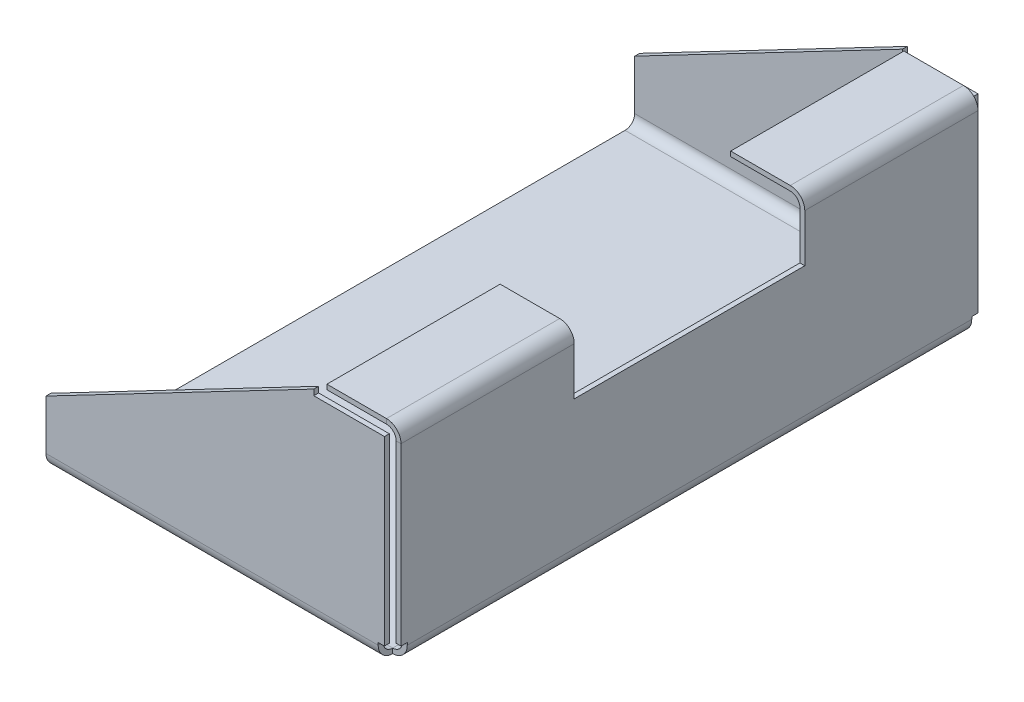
ISO-10303-21;
HEADER;
FILE_DESCRIPTION(('STEP AP214'),'2;1');
FILE_NAME('part.step','',(''),(''),'','','');
FILE_SCHEMA(('AUTOMOTIVE_DESIGN { 1 0 10303 214 1 1 1 1 }'));
ENDSEC;
DATA;
#1=APPLICATION_CONTEXT('core data for automotive mechanical design processes');
#2=APPLICATION_PROTOCOL_DEFINITION('international standard','automotive_design',2000,#1);
#3=PRODUCT_CONTEXT('',#1,'mechanical');
#4=PRODUCT('Part','Part','',(#3));
#5=PRODUCT_RELATED_PRODUCT_CATEGORY('part','',(#4));
#6=PRODUCT_DEFINITION_FORMATION('','',#4);
#7=PRODUCT_DEFINITION_CONTEXT('part definition',#1,'design');
#8=PRODUCT_DEFINITION('design','',#6,#7);
#9=PRODUCT_DEFINITION_SHAPE('','',#8);
#10=(LENGTH_UNIT() NAMED_UNIT(*) SI_UNIT(.MILLI.,.METRE.));
#11=(NAMED_UNIT(*) PLANE_ANGLE_UNIT() SI_UNIT($,.RADIAN.));
#12=(NAMED_UNIT(*) SI_UNIT($,.STERADIAN.) SOLID_ANGLE_UNIT());
#13=UNCERTAINTY_MEASURE_WITH_UNIT(LENGTH_MEASURE(1.E-05),#10,'distance_accuracy_value','');
#14=(GEOMETRIC_REPRESENTATION_CONTEXT(3) GLOBAL_UNCERTAINTY_ASSIGNED_CONTEXT((#13)) GLOBAL_UNIT_ASSIGNED_CONTEXT((#10,
#11,#12)) REPRESENTATION_CONTEXT('',''));
#15=CARTESIAN_POINT('',(0.,0.,0.));
#16=DIRECTION('',(0.,0.,1.));
#17=DIRECTION('',(1.,0.,0.));
#18=AXIS2_PLACEMENT_3D('',#15,#16,#17);
#19=CARTESIAN_POINT('',(-30.5821388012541,85.3258568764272,245.));
#20=DIRECTION('',(-1.,0.,0.));
#21=DIRECTION('',(0.,0.,-1.));
#22=AXIS2_PLACEMENT_3D('',#19,#20,#21);
#23=PLANE('',#22);
#24=DIRECTION('',(0.,1.,0.));
#25=VECTOR('',#24,1.);
#26=CARTESIAN_POINT('',(-30.5821388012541,85.3258568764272,170.075602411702));
#27=LINE('',#26,#25);
#28=CARTESIAN_POINT('',(-30.5821388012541,83.3258568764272,170.075602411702));
#29=VERTEX_POINT('',#28);
#30=CARTESIAN_POINT('',(-30.5821388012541,85.3258568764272,170.075602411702));
#31=VERTEX_POINT('',#30);
#32=EDGE_CURVE('E726',#29,#31,#27,.T.);
#33=ORIENTED_EDGE('',*,*,#32,.F.);
#34=DIRECTION('',(0.,0.,-1.));
#35=VECTOR('',#34,1.);
#36=CARTESIAN_POINT('',(-30.5821388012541,83.3258568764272,245.));
#37=LINE('',#36,#35);
#38=CARTESIAN_POINT('',(-30.5821388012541,83.3258568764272,241.575786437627));
#39=VERTEX_POINT('',#38);
#40=EDGE_CURVE('E215',#39,#29,#37,.T.);
#41=ORIENTED_EDGE('',*,*,#40,.F.);
#42=DIRECTION('',(0.,1.,0.));
#43=VECTOR('',#42,1.);
#44=CARTESIAN_POINT('',(-30.5821388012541,85.3258568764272,241.575786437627));
#45=LINE('',#44,#43);
#46=CARTESIAN_POINT('',(-30.5821388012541,85.3258568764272,241.575786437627));
#47=VERTEX_POINT('',#46);
#48=EDGE_CURVE('E290',#39,#47,#45,.T.);
#49=ORIENTED_EDGE('',*,*,#48,.T.);
#50=DIRECTION('',(0.,0.,-1.));
#51=VECTOR('',#50,1.);
#52=CARTESIAN_POINT('',(-30.5821388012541,85.3258568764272,245.));
#53=LINE('',#52,#51);
#54=EDGE_CURVE('E463',#47,#31,#53,.T.);
#55=ORIENTED_EDGE('',*,*,#54,.T.);
#56=EDGE_LOOP('',(#33,#41,#49,#55));
#57=FACE_BOUND('',#56,.T.);
#58=ADVANCED_FACE('F15',(#57),#23,.T.);
#59=CARTESIAN_POINT('',(0.,85.3258568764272,245.));
#60=DIRECTION('',(0.,-1.,0.));
#61=DIRECTION('',(0.,0.,-1.));
#62=AXIS2_PLACEMENT_3D('',#59,#60,#61);
#63=PLANE('',#62);
#64=DIRECTION('',(0.,0.,-1.));
#65=VECTOR('',#64,1.);
#66=CARTESIAN_POINT('',(-6.,85.3258568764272,245.));
#67=LINE('',#66,#65);
#68=CARTESIAN_POINT('',(-6.,85.3258568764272,241.575786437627));
#69=VERTEX_POINT('',#68);
#70=CARTESIAN_POINT('',(-6.,85.3258568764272,170.075602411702));
#71=VERTEX_POINT('',#70);
#72=EDGE_CURVE('E519',#69,#71,#67,.T.);
#73=ORIENTED_EDGE('',*,*,#72,.T.);
#74=DIRECTION('',(1.,0.,0.));
#75=VECTOR('',#74,1.);
#76=CARTESIAN_POINT('',(-143.110892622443,85.3258568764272,170.075602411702));
#77=LINE('',#76,#75);
#78=EDGE_CURVE('E710',#31,#71,#77,.T.);
#79=ORIENTED_EDGE('',*,*,#78,.F.);
#80=ORIENTED_EDGE('',*,*,#54,.F.);
#81=DIRECTION('',(-1.,0.,0.));
#82=VECTOR('',#81,1.);
#83=CARTESIAN_POINT('',(2.,85.3258568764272,241.575786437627));
#84=LINE('',#83,#82);
#85=EDGE_CURVE('E481',#47,#69,#84,.F.);
#86=ORIENTED_EDGE('',*,*,#85,.T.);
#87=EDGE_LOOP('',(#73,#79,#80,#86));
#88=FACE_BOUND('',#87,.T.);
#89=ADVANCED_FACE('F733',(#88),#63,.F.);
#90=CARTESIAN_POINT('',(-6.,79.3258568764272,245.));
#91=DIRECTION('',(0.,0.,-1.));
#92=DIRECTION('',(-1.,0.,0.));
#93=AXIS2_PLACEMENT_3D('',#90,#91,#92);
#94=CYLINDRICAL_SURFACE('',#93,6.);
#95=CARTESIAN_POINT('',(-6.,79.3258568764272,170.075602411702));
#96=DIRECTION('',(0.,0.,1.));
#97=DIRECTION('',(1.,0.,0.));
#98=AXIS2_PLACEMENT_3D('',#95,#96,#97);
#99=CIRCLE('',#98,6.);
#100=CARTESIAN_POINT('',(0.,79.3258568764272,170.075602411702));
#101=VERTEX_POINT('',#100);
#102=EDGE_CURVE('E278',#71,#101,#99,.F.);
#103=ORIENTED_EDGE('',*,*,#102,.F.);
#104=ORIENTED_EDGE('',*,*,#72,.F.);
#105=CARTESIAN_POINT('',(-6.,79.3258568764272,241.575786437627));
#106=DIRECTION('',(0.,0.,1.));
#107=DIRECTION('',(1.,0.,0.));
#108=AXIS2_PLACEMENT_3D('',#105,#106,#107);
#109=CIRCLE('',#108,6.);
#110=CARTESIAN_POINT('',(0.,79.3258568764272,241.575786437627));
#111=VERTEX_POINT('',#110);
#112=EDGE_CURVE('E453',#69,#111,#109,.F.);
#113=ORIENTED_EDGE('',*,*,#112,.T.);
#114=DIRECTION('',(0.,0.,-1.));
#115=VECTOR('',#114,1.);
#116=CARTESIAN_POINT('',(0.,79.3258568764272,245.));
#117=LINE('',#116,#115);
#118=EDGE_CURVE('E522',#101,#111,#117,.F.);
#119=ORIENTED_EDGE('',*,*,#118,.F.);
#120=EDGE_LOOP('',(#103,#104,#113,#119));
#121=FACE_BOUND('',#120,.T.);
#122=ADVANCED_FACE('F746',(#121),#94,.T.);
#123=CARTESIAN_POINT('',(0.,83.3258568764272,245.));
#124=DIRECTION('',(0.,-1.,0.));
#125=DIRECTION('',(0.,0.,-1.));
#126=AXIS2_PLACEMENT_3D('',#123,#124,#125);
#127=PLANE('',#126);
#128=DIRECTION('',(-1.,0.,0.));
#129=VECTOR('',#128,1.);
#130=CARTESIAN_POINT('',(0.,83.3258568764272,170.075602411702));
#131=LINE('',#130,#129);
#132=CARTESIAN_POINT('',(-6.,83.3258568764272,170.075602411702));
#133=VERTEX_POINT('',#132);
#134=EDGE_CURVE('E723',#133,#29,#131,.T.);
#135=ORIENTED_EDGE('',*,*,#134,.F.);
#136=DIRECTION('',(0.,0.,-1.));
#137=VECTOR('',#136,1.);
#138=CARTESIAN_POINT('',(-6.,83.3258568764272,245.));
#139=LINE('',#138,#137);
#140=CARTESIAN_POINT('',(-6.,83.3258568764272,241.575786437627));
#141=VERTEX_POINT('',#140);
#142=EDGE_CURVE('E380',#141,#133,#139,.T.);
#143=ORIENTED_EDGE('',*,*,#142,.F.);
#144=DIRECTION('',(1.,0.,0.));
#145=VECTOR('',#144,1.);
#146=CARTESIAN_POINT('',(0.,83.3258568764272,241.575786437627));
#147=LINE('',#146,#145);
#148=EDGE_CURVE('E210',#39,#141,#147,.T.);
#149=ORIENTED_EDGE('',*,*,#148,.F.);
#150=ORIENTED_EDGE('',*,*,#40,.T.);
#151=EDGE_LOOP('',(#135,#143,#149,#150));
#152=FACE_BOUND('',#151,.T.);
#153=ADVANCED_FACE('F740',(#152),#127,.T.);
#154=CARTESIAN_POINT('',(-6.,79.3258568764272,245.));
#155=DIRECTION('',(0.,0.,-1.));
#156=DIRECTION('',(-1.,0.,0.));
#157=AXIS2_PLACEMENT_3D('',#154,#155,#156);
#158=CYLINDRICAL_SURFACE('',#157,4.);
#159=ORIENTED_EDGE('',*,*,#142,.T.);
#160=CARTESIAN_POINT('',(-6.,79.3258568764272,170.075602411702));
#161=DIRECTION('',(0.,0.,1.));
#162=DIRECTION('',(1.,0.,0.));
#163=AXIS2_PLACEMENT_3D('',#160,#161,#162);
#164=CIRCLE('',#163,4.);
#165=CARTESIAN_POINT('',(-2.,79.3258568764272,170.075602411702));
#166=VERTEX_POINT('',#165);
#167=EDGE_CURVE('E23',#133,#166,#164,.F.);
#168=ORIENTED_EDGE('',*,*,#167,.T.);
#169=DIRECTION('',(0.,0.,1.));
#170=VECTOR('',#169,1.);
#171=CARTESIAN_POINT('',(-2.,79.3258568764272,245.));
#172=LINE('',#171,#170);
#173=CARTESIAN_POINT('',(-2.,79.3258568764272,241.575786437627));
#174=VERTEX_POINT('',#173);
#175=EDGE_CURVE('E376',#166,#174,#172,.T.);
#176=ORIENTED_EDGE('',*,*,#175,.T.);
#177=CARTESIAN_POINT('',(-6.,79.3258568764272,241.575786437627));
#178=DIRECTION('',(0.,0.,-1.));
#179=DIRECTION('',(-1.,0.,0.));
#180=AXIS2_PLACEMENT_3D('',#177,#178,#179);
#181=CIRCLE('',#180,4.);
#182=EDGE_CURVE('E206',#141,#174,#181,.T.);
#183=ORIENTED_EDGE('',*,*,#182,.F.);
#184=EDGE_LOOP('',(#159,#168,#176,#183));
#185=FACE_BOUND('',#184,.T.);
#186=ADVANCED_FACE('F374',(#185),#158,.F.);
#187=CARTESIAN_POINT('',(-6.,6.,239.));
#188=DIRECTION('',(1.,0.,0.));
#189=DIRECTION('',(0.,0.,-1.));
#190=AXIS2_PLACEMENT_3D('',#187,#188,#189);
#191=PLANE('',#190);
#192=DIRECTION('',(0.,-1.,0.));
#193=VECTOR('',#192,1.);
#194=CARTESIAN_POINT('',(-6.,0.,239.));
#195=LINE('',#194,#193);
#196=CARTESIAN_POINT('',(-6.,2.,239.));
#197=VERTEX_POINT('',#196);
#198=CARTESIAN_POINT('',(-6.,0.,239.));
#199=VERTEX_POINT('',#198);
#200=EDGE_CURVE('E365',#197,#199,#195,.T.);
#201=ORIENTED_EDGE('',*,*,#200,.F.);
#202=CARTESIAN_POINT('',(-6.,6.,239.));
#203=DIRECTION('',(-1.,0.,0.));
#204=DIRECTION('',(0.,0.,1.));
#205=AXIS2_PLACEMENT_3D('',#202,#203,#204);
#206=CIRCLE('',#205,4.);
#207=CARTESIAN_POINT('',(-6.,6.,243.));
#208=VERTEX_POINT('',#207);
#209=EDGE_CURVE('E262',#197,#208,#206,.T.);
#210=ORIENTED_EDGE('',*,*,#209,.T.);
#211=DIRECTION('',(0.,0.,1.));
#212=VECTOR('',#211,1.);
#213=CARTESIAN_POINT('',(-6.,6.,245.));
#214=LINE('',#213,#212);
#215=CARTESIAN_POINT('',(-6.,6.,245.));
#216=VERTEX_POINT('',#215);
#217=EDGE_CURVE('E362',#208,#216,#214,.T.);
#218=ORIENTED_EDGE('',*,*,#217,.T.);
#219=CARTESIAN_POINT('',(-6.,6.,239.));
#220=DIRECTION('',(-1.,0.,0.));
#221=DIRECTION('',(0.,0.,1.));
#222=AXIS2_PLACEMENT_3D('',#219,#220,#221);
#223=CIRCLE('',#222,6.);
#224=EDGE_CURVE('E400',#199,#216,#223,.T.);
#225=ORIENTED_EDGE('',*,*,#224,.F.);
#226=EDGE_LOOP('',(#201,#210,#218,#225));
#227=FACE_BOUND('',#226,.T.);
#228=ADVANCED_FACE('F420',(#227),#191,.T.);
#229=CARTESIAN_POINT('',(-6.,0.,245.));
#230=DIRECTION('',(1.,0.,0.));
#231=DIRECTION('',(0.,1.,0.));
#232=AXIS2_PLACEMENT_3D('',#229,#230,#231);
#233=PLANE('',#232);
#234=ORIENTED_EDGE('',*,*,#217,.F.);
#235=DIRECTION('',(0.,1.,0.));
#236=VECTOR('',#235,1.);
#237=CARTESIAN_POINT('',(-6.,0.,243.));
#238=LINE('',#237,#236);
#239=CARTESIAN_POINT('',(-6.,6.990599,243.));
#240=VERTEX_POINT('',#239);
#241=EDGE_CURVE('E195',#208,#240,#238,.T.);
#242=ORIENTED_EDGE('',*,*,#241,.T.);
#243=DIRECTION('',(0.,0.,1.));
#244=VECTOR('',#243,1.);
#245=CARTESIAN_POINT('',(-6.,6.990599,245.));
#246=LINE('',#245,#244);
#247=CARTESIAN_POINT('',(-6.,6.990599,245.));
#248=VERTEX_POINT('',#247);
#249=EDGE_CURVE('E359',#240,#248,#246,.T.);
#250=ORIENTED_EDGE('',*,*,#249,.T.);
#251=DIRECTION('',(0.,1.,0.));
#252=VECTOR('',#251,1.);
#253=CARTESIAN_POINT('',(-6.,0.,245.));
#254=LINE('',#253,#252);
#255=EDGE_CURVE('E499',#216,#248,#254,.T.);
#256=ORIENTED_EDGE('',*,*,#255,.F.);
#257=EDGE_LOOP('',(#234,#242,#250,#256));
#258=FACE_BOUND('',#257,.T.);
#259=ADVANCED_FACE('F1068',(#258),#233,.T.);
#260=CARTESIAN_POINT('',(0.,6.990599,245.));
#261=DIRECTION('',(0.,1.,0.));
#262=DIRECTION('',(-1.,0.,0.));
#263=AXIS2_PLACEMENT_3D('',#260,#261,#262);
#264=PLANE('',#263);
#265=ORIENTED_EDGE('',*,*,#249,.F.);
#266=DIRECTION('',(1.,0.,0.));
#267=VECTOR('',#266,1.);
#268=CARTESIAN_POINT('',(0.,6.990599,243.));
#269=LINE('',#268,#267);
#270=CARTESIAN_POINT('',(-3.42421356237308,6.990599,243.));
#271=VERTEX_POINT('',#270);
#272=EDGE_CURVE('E204',#271,#240,#269,.F.);
#273=ORIENTED_EDGE('',*,*,#272,.F.);
#274=DIRECTION('',(0.,0.,1.));
#275=VECTOR('',#274,1.);
#276=CARTESIAN_POINT('',(-3.42421356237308,6.990599,245.));
#277=LINE('',#276,#275);
#278=CARTESIAN_POINT('',(-3.42421356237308,6.990599,245.));
#279=VERTEX_POINT('',#278);
#280=EDGE_CURVE('E356',#271,#279,#277,.T.);
#281=ORIENTED_EDGE('',*,*,#280,.T.);
#282=DIRECTION('',(-1.,0.,0.));
#283=VECTOR('',#282,1.);
#284=CARTESIAN_POINT('',(0.,6.990599,245.));
#285=LINE('',#284,#283);
#286=EDGE_CURVE('E496',#279,#248,#285,.T.);
#287=ORIENTED_EDGE('',*,*,#286,.T.);
#288=EDGE_LOOP('',(#265,#273,#281,#287));
#289=FACE_BOUND('',#288,.T.);
#290=ADVANCED_FACE('F1075',(#289),#264,.F.);
#291=CARTESIAN_POINT('',(-3.42421356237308,-2.,245.));
#292=DIRECTION('',(1.,0.,0.));
#293=DIRECTION('',(0.,1.,0.));
#294=AXIS2_PLACEMENT_3D('',#291,#292,#293);
#295=PLANE('',#294);
#296=ORIENTED_EDGE('',*,*,#280,.F.);
#297=DIRECTION('',(0.,1.,0.));
#298=VECTOR('',#297,1.);
#299=CARTESIAN_POINT('',(-3.42421356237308,0.,243.));
#300=LINE('',#299,#298);
#301=CARTESIAN_POINT('',(-3.42421356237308,81.9016433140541,243.));
#302=VERTEX_POINT('',#301);
#303=EDGE_CURVE('E205',#302,#271,#300,.F.);
#304=ORIENTED_EDGE('',*,*,#303,.F.);
#305=DIRECTION('',(0.,0.,1.));
#306=VECTOR('',#305,1.);
#307=CARTESIAN_POINT('',(-3.42421356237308,81.9016433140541,245.));
#308=LINE('',#307,#306);
#309=CARTESIAN_POINT('',(-3.42421356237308,81.9016433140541,245.));
#310=VERTEX_POINT('',#309);
#311=EDGE_CURVE('E353',#302,#310,#308,.T.);
#312=ORIENTED_EDGE('',*,*,#311,.T.);
#313=DIRECTION('',(0.,1.,0.));
#314=VECTOR('',#313,1.);
#315=CARTESIAN_POINT('',(-3.42421356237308,-2.,245.));
#316=LINE('',#315,#314);
#317=EDGE_CURVE('E490',#310,#279,#316,.F.);
#318=ORIENTED_EDGE('',*,*,#317,.T.);
#319=EDGE_LOOP('',(#296,#304,#312,#318));
#320=FACE_BOUND('',#319,.T.);
#321=ADVANCED_FACE('F1083',(#320),#295,.T.);
#322=CARTESIAN_POINT('',(2.,81.9016433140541,245.));
#323=DIRECTION('',(0.,1.,0.));
#324=DIRECTION('',(-1.,0.,0.));
#325=AXIS2_PLACEMENT_3D('',#322,#323,#324);
#326=PLANE('',#325);
#327=ORIENTED_EDGE('',*,*,#311,.F.);
#328=DIRECTION('',(1.,0.,0.));
#329=VECTOR('',#328,1.);
#330=CARTESIAN_POINT('',(0.,81.9016433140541,243.));
#331=LINE('',#330,#329);
#332=CARTESIAN_POINT('',(-32.5821388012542,81.9016433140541,243.));
#333=VERTEX_POINT('',#332);
#334=EDGE_CURVE('E223',#333,#302,#331,.T.);
#335=ORIENTED_EDGE('',*,*,#334,.F.);
#336=DIRECTION('',(0.,0.,1.));
#337=VECTOR('',#336,1.);
#338=CARTESIAN_POINT('',(-32.5821388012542,81.9016433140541,245.));
#339=LINE('',#338,#337);
#340=CARTESIAN_POINT('',(-32.5821388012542,81.9016433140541,245.));
#341=VERTEX_POINT('',#340);
#342=EDGE_CURVE('E350',#333,#341,#339,.T.);
#343=ORIENTED_EDGE('',*,*,#342,.T.);
#344=DIRECTION('',(-1.,0.,0.));
#345=VECTOR('',#344,1.);
#346=CARTESIAN_POINT('',(2.,81.9016433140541,245.));
#347=LINE('',#346,#345);
#348=EDGE_CURVE('E475',#341,#310,#347,.F.);
#349=ORIENTED_EDGE('',*,*,#348,.T.);
#350=EDGE_LOOP('',(#327,#335,#343,#349));
#351=FACE_BOUND('',#350,.T.);
#352=ADVANCED_FACE('F1092',(#351),#326,.T.);
#353=CARTESIAN_POINT('',(-32.5821388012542,0.,245.));
#354=DIRECTION('',(-1.,0.,0.));
#355=DIRECTION('',(0.,-1.,0.));
#356=AXIS2_PLACEMENT_3D('',#353,#354,#355);
#357=PLANE('',#356);
#358=ORIENTED_EDGE('',*,*,#342,.F.);
#359=DIRECTION('',(0.,1.,0.));
#360=VECTOR('',#359,1.);
#361=CARTESIAN_POINT('',(-32.5821388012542,0.,243.));
#362=LINE('',#361,#360);
#363=CARTESIAN_POINT('',(-32.5821388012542,84.2808118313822,243.));
#364=VERTEX_POINT('',#363);
#365=EDGE_CURVE('E214',#364,#333,#362,.F.);
#366=ORIENTED_EDGE('',*,*,#365,.F.);
#367=DIRECTION('',(0.,0.,1.));
#368=VECTOR('',#367,1.);
#369=CARTESIAN_POINT('',(-32.5821388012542,84.2808118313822,245.));
#370=LINE('',#369,#368);
#371=CARTESIAN_POINT('',(-32.5821388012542,84.2808118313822,245.));
#372=VERTEX_POINT('',#371);
#373=EDGE_CURVE('E347',#364,#372,#370,.T.);
#374=ORIENTED_EDGE('',*,*,#373,.T.);
#375=DIRECTION('',(0.,-1.,0.));
#376=VECTOR('',#375,1.);
#377=CARTESIAN_POINT('',(-32.5821388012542,0.,245.));
#378=LINE('',#377,#376);
#379=EDGE_CURVE('E478',#372,#341,#378,.T.);
#380=ORIENTED_EDGE('',*,*,#379,.T.);
#381=EDGE_LOOP('',(#358,#366,#374,#380));
#382=FACE_BOUND('',#381,.T.);
#383=ADVANCED_FACE('F1101',(#382),#357,.F.);
#384=CARTESIAN_POINT('',(-30.5821388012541,85.3258568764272,245.));
#385=DIRECTION('',(-0.463111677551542,0.886299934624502,0.));
#386=DIRECTION('',(-0.886299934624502,-0.463111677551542,0.));
#387=AXIS2_PLACEMENT_3D('',#384,#385,#386);
#388=PLANE('',#387);
#389=ORIENTED_EDGE('',*,*,#373,.F.);
#390=DIRECTION('',(-0.886299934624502,-0.463111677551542,0.));
#391=VECTOR('',#390,1.);
#392=CARTESIAN_POINT('',(-30.5821388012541,85.3258568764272,243.));
#393=LINE('',#392,#391);
#394=CARTESIAN_POINT('',(-143.110892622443,26.5270485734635,243.));
#395=VERTEX_POINT('',#394);
#396=EDGE_CURVE('E209',#364,#395,#393,.T.);
#397=ORIENTED_EDGE('',*,*,#396,.T.);
#398=DIRECTION('',(0.,0.,1.));
#399=VECTOR('',#398,1.);
#400=CARTESIAN_POINT('',(-143.110892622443,26.5270485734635,245.));
#401=LINE('',#400,#399);
#402=CARTESIAN_POINT('',(-143.110892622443,26.5270485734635,245.));
#403=VERTEX_POINT('',#402);
#404=EDGE_CURVE('E344',#395,#403,#401,.T.);
#405=ORIENTED_EDGE('',*,*,#404,.T.);
#406=DIRECTION('',(-0.886299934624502,-0.463111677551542,0.));
#407=VECTOR('',#406,1.);
#408=CARTESIAN_POINT('',(-30.5821388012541,85.3258568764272,245.));
#409=LINE('',#408,#407);
#410=EDGE_CURVE('E447',#372,#403,#409,.T.);
#411=ORIENTED_EDGE('',*,*,#410,.F.);
#412=EDGE_LOOP('',(#389,#397,#405,#411));
#413=FACE_BOUND('',#412,.T.);
#414=ADVANCED_FACE('F1110',(#413),#388,.T.);
#415=CARTESIAN_POINT('',(-143.110892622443,26.5270485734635,245.));
#416=DIRECTION('',(-1.,0.,0.));
#417=DIRECTION('',(0.,-1.,0.));
#418=AXIS2_PLACEMENT_3D('',#415,#416,#417);
#419=PLANE('',#418);
#420=ORIENTED_EDGE('',*,*,#404,.F.);
#421=DIRECTION('',(0.,1.,0.));
#422=VECTOR('',#421,1.);
#423=CARTESIAN_POINT('',(-143.110892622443,0.,243.));
#424=LINE('',#423,#422);
#425=CARTESIAN_POINT('',(-143.110892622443,6.,243.));
#426=VERTEX_POINT('',#425);
#427=EDGE_CURVE('E260',#395,#426,#424,.F.);
#428=ORIENTED_EDGE('',*,*,#427,.T.);
#429=DIRECTION('',(0.,0.,1.));
#430=VECTOR('',#429,1.);
#431=CARTESIAN_POINT('',(-143.110892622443,6.,245.));
#432=LINE('',#431,#430);
#433=CARTESIAN_POINT('',(-143.110892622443,6.,245.));
#434=VERTEX_POINT('',#433);
#435=EDGE_CURVE('E342',#426,#434,#432,.T.);
#436=ORIENTED_EDGE('',*,*,#435,.T.);
#437=DIRECTION('',(0.,-1.,0.));
#438=VECTOR('',#437,1.);
#439=CARTESIAN_POINT('',(-143.110892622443,26.5270485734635,245.));
#440=LINE('',#439,#438);
#441=EDGE_CURVE('E438',#403,#434,#440,.T.);
#442=ORIENTED_EDGE('',*,*,#441,.F.);
#443=EDGE_LOOP('',(#420,#428,#436,#442));
#444=FACE_BOUND('',#443,.T.);
#445=ADVANCED_FACE('F437',(#444),#419,.T.);
#446=CARTESIAN_POINT('',(-143.110892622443,6.,239.));
#447=DIRECTION('',(1.,0.,0.));
#448=DIRECTION('',(0.,0.,-1.));
#449=AXIS2_PLACEMENT_3D('',#446,#447,#448);
#450=PLANE('',#449);
#451=ORIENTED_EDGE('',*,*,#435,.F.);
#452=CARTESIAN_POINT('',(-143.110892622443,6.,239.));
#453=DIRECTION('',(-1.,0.,0.));
#454=DIRECTION('',(0.,0.,1.));
#455=AXIS2_PLACEMENT_3D('',#452,#453,#454);
#456=CIRCLE('',#455,4.);
#457=CARTESIAN_POINT('',(-143.110892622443,2.,239.));
#458=VERTEX_POINT('',#457);
#459=EDGE_CURVE('E240',#426,#458,#456,.F.);
#460=ORIENTED_EDGE('',*,*,#459,.T.);
#461=DIRECTION('',(0.,-1.,0.));
#462=VECTOR('',#461,1.);
#463=CARTESIAN_POINT('',(-143.110892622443,0.,239.));
#464=LINE('',#463,#462);
#465=CARTESIAN_POINT('',(-143.110892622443,0.,239.));
#466=VERTEX_POINT('',#465);
#467=EDGE_CURVE('E39',#458,#466,#464,.T.);
#468=ORIENTED_EDGE('',*,*,#467,.T.);
#469=CARTESIAN_POINT('',(-143.110892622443,6.,239.));
#470=DIRECTION('',(-1.,0.,0.));
#471=DIRECTION('',(0.,0.,1.));
#472=AXIS2_PLACEMENT_3D('',#469,#470,#471);
#473=CIRCLE('',#472,6.);
#474=EDGE_CURVE('E432',#434,#466,#473,.F.);
#475=ORIENTED_EDGE('',*,*,#474,.F.);
#476=EDGE_LOOP('',(#451,#460,#468,#475));
#477=FACE_BOUND('',#476,.T.);
#478=ADVANCED_FACE('F431',(#477),#450,.F.);
#479=CARTESIAN_POINT('',(-143.110892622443,0.,245.));
#480=DIRECTION('',(1.,0.,0.));
#481=DIRECTION('',(0.,0.,-1.));
#482=AXIS2_PLACEMENT_3D('',#479,#480,#481);
#483=PLANE('',#482);
#484=ORIENTED_EDGE('',*,*,#467,.F.);
#485=DIRECTION('',(0.,0.,1.));
#486=VECTOR('',#485,1.);
#487=CARTESIAN_POINT('',(-143.110892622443,2.,245.));
#488=LINE('',#487,#486);
#489=CARTESIAN_POINT('',(-143.110892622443,2.,6.));
#490=VERTEX_POINT('',#489);
#491=EDGE_CURVE('E255',#458,#490,#488,.F.);
#492=ORIENTED_EDGE('',*,*,#491,.T.);
#493=DIRECTION('',(0.,-1.,0.));
#494=VECTOR('',#493,1.);
#495=CARTESIAN_POINT('',(-143.110892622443,0.,6.));
#496=LINE('',#495,#494);
#497=CARTESIAN_POINT('',(-143.110892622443,0.,6.));
#498=VERTEX_POINT('',#497);
#499=EDGE_CURVE('E338',#490,#498,#496,.T.);
#500=ORIENTED_EDGE('',*,*,#499,.T.);
#501=DIRECTION('',(0.,0.,-1.));
#502=VECTOR('',#501,1.);
#503=CARTESIAN_POINT('',(-143.110892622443,0.,245.));
#504=LINE('',#503,#502);
#505=EDGE_CURVE('E448',#466,#498,#504,.T.);
#506=ORIENTED_EDGE('',*,*,#505,.F.);
#507=EDGE_LOOP('',(#484,#492,#500,#506));
#508=FACE_BOUND('',#507,.T.);
#509=ADVANCED_FACE('F559',(#508),#483,.F.);
#510=CARTESIAN_POINT('',(-143.110892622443,6.,6.));
#511=DIRECTION('',(-1.,0.,0.));
#512=DIRECTION('',(0.,0.,1.));
#513=AXIS2_PLACEMENT_3D('',#510,#511,#512);
#514=PLANE('',#513);
#515=ORIENTED_EDGE('',*,*,#499,.F.);
#516=CARTESIAN_POINT('',(-143.110892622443,6.,6.));
#517=DIRECTION('',(1.,0.,0.));
#518=DIRECTION('',(0.,0.,-1.));
#519=AXIS2_PLACEMENT_3D('',#516,#517,#518);
#520=CIRCLE('',#519,4.);
#521=CARTESIAN_POINT('',(-143.110892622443,6.,2.));
#522=VERTEX_POINT('',#521);
#523=EDGE_CURVE('E236',#490,#522,#520,.T.);
#524=ORIENTED_EDGE('',*,*,#523,.T.);
#525=DIRECTION('',(0.,0.,-1.));
#526=VECTOR('',#525,1.);
#527=CARTESIAN_POINT('',(-143.110892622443,6.,0.));
#528=LINE('',#527,#526);
#529=CARTESIAN_POINT('',(-143.110892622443,6.,0.));
#530=VERTEX_POINT('',#529);
#531=EDGE_CURVE('E335',#522,#530,#528,.T.);
#532=ORIENTED_EDGE('',*,*,#531,.T.);
#533=CARTESIAN_POINT('',(-143.110892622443,6.,6.));
#534=DIRECTION('',(1.,0.,0.));
#535=DIRECTION('',(0.,0.,-1.));
#536=AXIS2_PLACEMENT_3D('',#533,#534,#535);
#537=CIRCLE('',#536,6.);
#538=EDGE_CURVE('E540',#498,#530,#537,.T.);
#539=ORIENTED_EDGE('',*,*,#538,.F.);
#540=EDGE_LOOP('',(#515,#524,#532,#539));
#541=FACE_BOUND('',#540,.T.);
#542=ADVANCED_FACE('F603',(#541),#514,.T.);
#543=CARTESIAN_POINT('',(-143.110892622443,26.5270485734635,0.));
#544=DIRECTION('',(-1.,0.,0.));
#545=DIRECTION('',(0.,-1.,0.));
#546=AXIS2_PLACEMENT_3D('',#543,#544,#545);
#547=PLANE('',#546);
#548=ORIENTED_EDGE('',*,*,#531,.F.);
#549=DIRECTION('',(0.,1.,0.));
#550=VECTOR('',#549,1.);
#551=CARTESIAN_POINT('',(-143.110892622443,0.,2.));
#552=LINE('',#551,#550);
#553=CARTESIAN_POINT('',(-143.110892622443,26.5270485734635,2.));
#554=VERTEX_POINT('',#553);
#555=EDGE_CURVE('E252',#554,#522,#552,.F.);
#556=ORIENTED_EDGE('',*,*,#555,.F.);
#557=DIRECTION('',(0.,0.,-1.));
#558=VECTOR('',#557,1.);
#559=CARTESIAN_POINT('',(-143.110892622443,26.5270485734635,0.));
#560=LINE('',#559,#558);
#561=CARTESIAN_POINT('',(-143.110892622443,26.5270485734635,0.));
#562=VERTEX_POINT('',#561);
#563=EDGE_CURVE('E332',#554,#562,#560,.T.);
#564=ORIENTED_EDGE('',*,*,#563,.T.);
#565=DIRECTION('',(0.,-1.,0.));
#566=VECTOR('',#565,1.);
#567=CARTESIAN_POINT('',(-143.110892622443,26.5270485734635,0.));
#568=LINE('',#567,#566);
#569=EDGE_CURVE('E451',#562,#530,#568,.T.);
#570=ORIENTED_EDGE('',*,*,#569,.T.);
#571=EDGE_LOOP('',(#548,#556,#564,#570));
#572=FACE_BOUND('',#571,.T.);
#573=ADVANCED_FACE('F610',(#572),#547,.T.);
#574=CARTESIAN_POINT('',(-30.5821388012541,85.3258568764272,0.));
#575=DIRECTION('',(-0.463111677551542,0.886299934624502,0.));
#576=DIRECTION('',(-0.886299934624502,-0.463111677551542,0.));
#577=AXIS2_PLACEMENT_3D('',#574,#575,#576);
#578=PLANE('',#577);
#579=ORIENTED_EDGE('',*,*,#563,.F.);
#580=DIRECTION('',(-0.886299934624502,-0.463111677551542,0.));
#581=VECTOR('',#580,1.);
#582=CARTESIAN_POINT('',(-30.5821388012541,85.3258568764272,2.));
#583=LINE('',#582,#581);
#584=CARTESIAN_POINT('',(-32.5821388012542,84.2808118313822,2.));
#585=VERTEX_POINT('',#584);
#586=EDGE_CURVE('E249',#585,#554,#583,.T.);
#587=ORIENTED_EDGE('',*,*,#586,.F.);
#588=DIRECTION('',(0.,0.,-1.));
#589=VECTOR('',#588,1.);
#590=CARTESIAN_POINT('',(-32.5821388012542,84.2808118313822,0.));
#591=LINE('',#590,#589);
#592=CARTESIAN_POINT('',(-32.5821388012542,84.2808118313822,0.));
#593=VERTEX_POINT('',#592);
#594=EDGE_CURVE('E329',#585,#593,#591,.T.);
#595=ORIENTED_EDGE('',*,*,#594,.T.);
#596=DIRECTION('',(-0.886299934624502,-0.463111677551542,0.));
#597=VECTOR('',#596,1.);
#598=CARTESIAN_POINT('',(-30.5821388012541,85.3258568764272,0.));
#599=LINE('',#598,#597);
#600=EDGE_CURVE('E459',#593,#562,#599,.T.);
#601=ORIENTED_EDGE('',*,*,#600,.T.);
#602=EDGE_LOOP('',(#579,#587,#595,#601));
#603=FACE_BOUND('',#602,.T.);
#604=ADVANCED_FACE('F1155',(#603),#578,.T.);
#605=CARTESIAN_POINT('',(-32.5821388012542,0.,0.));
#606=DIRECTION('',(-1.,0.,0.));
#607=DIRECTION('',(0.,-1.,0.));
#608=AXIS2_PLACEMENT_3D('',#605,#606,#607);
#609=PLANE('',#608);
#610=ORIENTED_EDGE('',*,*,#594,.F.);
#611=DIRECTION('',(0.,1.,0.));
#612=VECTOR('',#611,1.);
#613=CARTESIAN_POINT('',(-32.5821388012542,0.,2.));
#614=LINE('',#613,#612);
#615=CARTESIAN_POINT('',(-32.5821388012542,81.9016433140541,2.));
#616=VERTEX_POINT('',#615);
#617=EDGE_CURVE('E224',#585,#616,#614,.F.);
#618=ORIENTED_EDGE('',*,*,#617,.T.);
#619=DIRECTION('',(0.,0.,-1.));
#620=VECTOR('',#619,1.);
#621=CARTESIAN_POINT('',(-32.5821388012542,81.9016433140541,0.));
#622=LINE('',#621,#620);
#623=CARTESIAN_POINT('',(-32.5821388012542,81.9016433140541,0.));
#624=VERTEX_POINT('',#623);
#625=EDGE_CURVE('E326',#616,#624,#622,.T.);
#626=ORIENTED_EDGE('',*,*,#625,.T.);
#627=DIRECTION('',(0.,-1.,0.));
#628=VECTOR('',#627,1.);
#629=CARTESIAN_POINT('',(-32.5821388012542,0.,0.));
#630=LINE('',#629,#628);
#631=EDGE_CURVE('E467',#593,#624,#630,.T.);
#632=ORIENTED_EDGE('',*,*,#631,.F.);
#633=EDGE_LOOP('',(#610,#618,#626,#632));
#634=FACE_BOUND('',#633,.T.);
#635=ADVANCED_FACE('F1163',(#634),#609,.F.);
#636=CARTESIAN_POINT('',(2.,81.9016433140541,0.));
#637=DIRECTION('',(0.,1.,0.));
#638=DIRECTION('',(-1.,0.,0.));
#639=AXIS2_PLACEMENT_3D('',#636,#637,#638);
#640=PLANE('',#639);
#641=ORIENTED_EDGE('',*,*,#625,.F.);
#642=DIRECTION('',(1.,0.,0.));
#643=VECTOR('',#642,1.);
#644=CARTESIAN_POINT('',(0.,81.9016433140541,2.));
#645=LINE('',#644,#643);
#646=CARTESIAN_POINT('',(-3.42421356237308,81.9016433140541,2.));
#647=VERTEX_POINT('',#646);
#648=EDGE_CURVE('E218',#616,#647,#645,.T.);
#649=ORIENTED_EDGE('',*,*,#648,.T.);
#650=DIRECTION('',(0.,0.,-1.));
#651=VECTOR('',#650,1.);
#652=CARTESIAN_POINT('',(-3.42421356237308,81.9016433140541,0.));
#653=LINE('',#652,#651);
#654=CARTESIAN_POINT('',(-3.42421356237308,81.9016433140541,0.));
#655=VERTEX_POINT('',#654);
#656=EDGE_CURVE('E323',#647,#655,#653,.T.);
#657=ORIENTED_EDGE('',*,*,#656,.T.);
#658=DIRECTION('',(-1.,0.,0.));
#659=VECTOR('',#658,1.);
#660=CARTESIAN_POINT('',(2.,81.9016433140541,0.));
#661=LINE('',#660,#659);
#662=EDGE_CURVE('E466',#624,#655,#661,.F.);
#663=ORIENTED_EDGE('',*,*,#662,.F.);
#664=EDGE_LOOP('',(#641,#649,#657,#663));
#665=FACE_BOUND('',#664,.T.);
#666=ADVANCED_FACE('F1172',(#665),#640,.T.);
#667=CARTESIAN_POINT('',(-3.42421356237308,-2.,0.));
#668=DIRECTION('',(1.,0.,0.));
#669=DIRECTION('',(0.,1.,0.));
#670=AXIS2_PLACEMENT_3D('',#667,#668,#669);
#671=PLANE('',#670);
#672=ORIENTED_EDGE('',*,*,#656,.F.);
#673=DIRECTION('',(0.,1.,0.));
#674=VECTOR('',#673,1.);
#675=CARTESIAN_POINT('',(-3.42421356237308,0.,2.));
#676=LINE('',#675,#674);
#677=CARTESIAN_POINT('',(-3.42421356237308,6.990599,2.));
#678=VERTEX_POINT('',#677);
#679=EDGE_CURVE('E229',#647,#678,#676,.F.);
#680=ORIENTED_EDGE('',*,*,#679,.T.);
#681=DIRECTION('',(0.,0.,-1.));
#682=VECTOR('',#681,1.);
#683=CARTESIAN_POINT('',(-3.42421356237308,6.990599,0.));
#684=LINE('',#683,#682);
#685=CARTESIAN_POINT('',(-3.42421356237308,6.990599,0.));
#686=VERTEX_POINT('',#685);
#687=EDGE_CURVE('E320',#678,#686,#684,.T.);
#688=ORIENTED_EDGE('',*,*,#687,.T.);
#689=DIRECTION('',(0.,1.,0.));
#690=VECTOR('',#689,1.);
#691=CARTESIAN_POINT('',(-3.42421356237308,-2.,0.));
#692=LINE('',#691,#690);
#693=EDGE_CURVE('E487',#655,#686,#692,.F.);
#694=ORIENTED_EDGE('',*,*,#693,.F.);
#695=EDGE_LOOP('',(#672,#680,#688,#694));
#696=FACE_BOUND('',#695,.T.);
#697=ADVANCED_FACE('F1181',(#696),#671,.T.);
#698=CARTESIAN_POINT('',(0.,6.990599,0.));
#699=DIRECTION('',(0.,1.,0.));
#700=DIRECTION('',(-1.,0.,0.));
#701=AXIS2_PLACEMENT_3D('',#698,#699,#700);
#702=PLANE('',#701);
#703=ORIENTED_EDGE('',*,*,#687,.F.);
#704=DIRECTION('',(1.,0.,0.));
#705=VECTOR('',#704,1.);
#706=CARTESIAN_POINT('',(0.,6.990599,2.));
#707=LINE('',#706,#705);
#708=CARTESIAN_POINT('',(-6.,6.990599,2.));
#709=VERTEX_POINT('',#708);
#710=EDGE_CURVE('E189',#678,#709,#707,.F.);
#711=ORIENTED_EDGE('',*,*,#710,.T.);
#712=DIRECTION('',(0.,0.,-1.));
#713=VECTOR('',#712,1.);
#714=CARTESIAN_POINT('',(-6.,6.990599,0.));
#715=LINE('',#714,#713);
#716=CARTESIAN_POINT('',(-6.,6.990599,0.));
#717=VERTEX_POINT('',#716);
#718=EDGE_CURVE('E317',#709,#717,#715,.T.);
#719=ORIENTED_EDGE('',*,*,#718,.T.);
#720=DIRECTION('',(-1.,0.,0.));
#721=VECTOR('',#720,1.);
#722=CARTESIAN_POINT('',(0.,6.990599,0.));
#723=LINE('',#722,#721);
#724=EDGE_CURVE('E506',#686,#717,#723,.T.);
#725=ORIENTED_EDGE('',*,*,#724,.F.);
#726=EDGE_LOOP('',(#703,#711,#719,#725));
#727=FACE_BOUND('',#726,.T.);
#728=ADVANCED_FACE('F1190',(#727),#702,.F.);
#729=CARTESIAN_POINT('',(-6.,0.,0.));
#730=DIRECTION('',(1.,0.,0.));
#731=DIRECTION('',(0.,1.,0.));
#732=AXIS2_PLACEMENT_3D('',#729,#730,#731);
#733=PLANE('',#732);
#734=ORIENTED_EDGE('',*,*,#718,.F.);
#735=DIRECTION('',(0.,1.,0.));
#736=VECTOR('',#735,1.);
#737=CARTESIAN_POINT('',(-6.,0.,2.));
#738=LINE('',#737,#736);
#739=CARTESIAN_POINT('',(-6.,6.,2.));
#740=VERTEX_POINT('',#739);
#741=EDGE_CURVE('E193',#740,#709,#738,.T.);
#742=ORIENTED_EDGE('',*,*,#741,.F.);
#743=DIRECTION('',(0.,0.,-1.));
#744=VECTOR('',#743,1.);
#745=CARTESIAN_POINT('',(-6.,6.,0.));
#746=LINE('',#745,#744);
#747=CARTESIAN_POINT('',(-6.,6.,0.));
#748=VERTEX_POINT('',#747);
#749=EDGE_CURVE('E314',#740,#748,#746,.T.);
#750=ORIENTED_EDGE('',*,*,#749,.T.);
#751=DIRECTION('',(0.,1.,0.));
#752=VECTOR('',#751,1.);
#753=CARTESIAN_POINT('',(-6.,0.,0.));
#754=LINE('',#753,#752);
#755=EDGE_CURVE('E509',#748,#717,#754,.T.);
#756=ORIENTED_EDGE('',*,*,#755,.T.);
#757=EDGE_LOOP('',(#734,#742,#750,#756));
#758=FACE_BOUND('',#757,.T.);
#759=ADVANCED_FACE('F1199',(#758),#733,.T.);
#760=CARTESIAN_POINT('',(-6.,6.,6.));
#761=DIRECTION('',(-1.,0.,0.));
#762=DIRECTION('',(0.,0.,1.));
#763=AXIS2_PLACEMENT_3D('',#760,#761,#762);
#764=PLANE('',#763);
#765=ORIENTED_EDGE('',*,*,#749,.F.);
#766=CARTESIAN_POINT('',(-6.,6.,6.));
#767=DIRECTION('',(1.,0.,0.));
#768=DIRECTION('',(0.,0.,-1.));
#769=AXIS2_PLACEMENT_3D('',#766,#767,#768);
#770=CIRCLE('',#769,4.);
#771=CARTESIAN_POINT('',(-6.,2.,6.));
#772=VERTEX_POINT('',#771);
#773=EDGE_CURVE('E237',#740,#772,#770,.F.);
#774=ORIENTED_EDGE('',*,*,#773,.T.);
#775=DIRECTION('',(0.,-1.,0.));
#776=VECTOR('',#775,1.);
#777=CARTESIAN_POINT('',(-6.,0.,6.));
#778=LINE('',#777,#776);
#779=CARTESIAN_POINT('',(-6.,0.,6.));
#780=VERTEX_POINT('',#779);
#781=EDGE_CURVE('E311',#772,#780,#778,.T.);
#782=ORIENTED_EDGE('',*,*,#781,.T.);
#783=CARTESIAN_POINT('',(-6.,6.,6.));
#784=DIRECTION('',(1.,0.,0.));
#785=DIRECTION('',(0.,0.,-1.));
#786=AXIS2_PLACEMENT_3D('',#783,#784,#785);
#787=CIRCLE('',#786,6.);
#788=EDGE_CURVE('E547',#748,#780,#787,.F.);
#789=ORIENTED_EDGE('',*,*,#788,.F.);
#790=EDGE_LOOP('',(#765,#774,#782,#789));
#791=FACE_BOUND('',#790,.T.);
#792=ADVANCED_FACE('F618',(#791),#764,.F.);
#793=CARTESIAN_POINT('',(-6.,6.,6.));
#794=DIRECTION('',(0.,0.,1.));
#795=DIRECTION('',(1.,0.,0.));
#796=AXIS2_PLACEMENT_3D('',#793,#794,#795);
#797=PLANE('',#796);
#798=ORIENTED_EDGE('',*,*,#781,.F.);
#799=CARTESIAN_POINT('',(-6.,6.,6.));
#800=DIRECTION('',(0.,0.,-1.));
#801=DIRECTION('',(-1.,0.,0.));
#802=AXIS2_PLACEMENT_3D('',#799,#800,#801);
#803=CIRCLE('',#802,4.);
#804=CARTESIAN_POINT('',(-2.,6.,6.));
#805=VERTEX_POINT('',#804);
#806=EDGE_CURVE('E185',#772,#805,#803,.F.);
#807=ORIENTED_EDGE('',*,*,#806,.T.);
#808=DIRECTION('',(1.,0.,0.));
#809=VECTOR('',#808,1.);
#810=CARTESIAN_POINT('',(0.,6.,6.));
#811=LINE('',#810,#809);
#812=CARTESIAN_POINT('',(0.,6.,6.));
#813=VERTEX_POINT('',#812);
#814=EDGE_CURVE('E308',#805,#813,#811,.T.);
#815=ORIENTED_EDGE('',*,*,#814,.T.);
#816=CARTESIAN_POINT('',(-6.,6.,6.));
#817=DIRECTION('',(0.,0.,-1.));
#818=DIRECTION('',(-1.,0.,0.));
#819=AXIS2_PLACEMENT_3D('',#816,#817,#818);
#820=CIRCLE('',#819,6.);
#821=EDGE_CURVE('E537',#780,#813,#820,.F.);
#822=ORIENTED_EDGE('',*,*,#821,.F.);
#823=EDGE_LOOP('',(#798,#807,#815,#822));
#824=FACE_BOUND('',#823,.T.);
#825=ADVANCED_FACE('F620',(#824),#797,.F.);
#826=CARTESIAN_POINT('',(0.,0.,6.));
#827=DIRECTION('',(0.,0.,-1.));
#828=DIRECTION('',(0.,-1.,0.));
#829=AXIS2_PLACEMENT_3D('',#826,#827,#828);
#830=PLANE('',#829);
#831=ORIENTED_EDGE('',*,*,#814,.F.);
#832=DIRECTION('',(0.,1.,0.));
#833=VECTOR('',#832,1.);
#834=CARTESIAN_POINT('',(-2.,0.,6.));
#835=LINE('',#834,#833);
#836=CARTESIAN_POINT('',(-2.,6.990599,6.));
#837=VERTEX_POINT('',#836);
#838=EDGE_CURVE('E173',#837,#805,#835,.F.);
#839=ORIENTED_EDGE('',*,*,#838,.F.);
#840=DIRECTION('',(1.,0.,0.));
#841=VECTOR('',#840,1.);
#842=CARTESIAN_POINT('',(0.,6.990599,6.));
#843=LINE('',#842,#841);
#844=CARTESIAN_POINT('',(0.,6.990599,6.));
#845=VERTEX_POINT('',#844);
#846=EDGE_CURVE('E305',#837,#845,#843,.T.);
#847=ORIENTED_EDGE('',*,*,#846,.T.);
#848=DIRECTION('',(0.,-1.,0.));
#849=VECTOR('',#848,1.);
#850=CARTESIAN_POINT('',(0.,0.,6.));
#851=LINE('',#850,#849);
#852=EDGE_CURVE('E515',#845,#813,#851,.T.);
#853=ORIENTED_EDGE('',*,*,#852,.T.);
#854=EDGE_LOOP('',(#831,#839,#847,#853));
#855=FACE_BOUND('',#854,.T.);
#856=ADVANCED_FACE('F622',(#855),#830,.T.);
#857=CARTESIAN_POINT('',(0.,6.990599,245.));
#858=DIRECTION('',(0.,1.,0.));
#859=DIRECTION('',(0.,0.,-1.));
#860=AXIS2_PLACEMENT_3D('',#857,#858,#859);
#861=PLANE('',#860);
#862=ORIENTED_EDGE('',*,*,#846,.F.);
#863=DIRECTION('',(0.,0.,1.));
#864=VECTOR('',#863,1.);
#865=CARTESIAN_POINT('',(-2.,6.990599,245.));
#866=LINE('',#865,#864);
#867=CARTESIAN_POINT('',(-2.,6.990599,3.42421356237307));
#868=VERTEX_POINT('',#867);
#869=EDGE_CURVE('E230',#837,#868,#866,.F.);
#870=ORIENTED_EDGE('',*,*,#869,.T.);
#871=DIRECTION('',(1.,0.,0.));
#872=VECTOR('',#871,1.);
#873=CARTESIAN_POINT('',(0.,6.990599,3.42421356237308));
#874=LINE('',#873,#872);
#875=CARTESIAN_POINT('',(0.,6.990599,3.42421356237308));
#876=VERTEX_POINT('',#875);
#877=EDGE_CURVE('E302',#868,#876,#874,.T.);
#878=ORIENTED_EDGE('',*,*,#877,.T.);
#879=DIRECTION('',(0.,0.,-1.));
#880=VECTOR('',#879,1.);
#881=CARTESIAN_POINT('',(0.,6.990599,245.));
#882=LINE('',#881,#880);
#883=EDGE_CURVE('E512',#845,#876,#882,.T.);
#884=ORIENTED_EDGE('',*,*,#883,.F.);
#885=EDGE_LOOP('',(#862,#870,#878,#884));
#886=FACE_BOUND('',#885,.T.);
#887=ADVANCED_FACE('F805',(#886),#861,.F.);
#888=CARTESIAN_POINT('',(0.,-2.,3.42421356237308));
#889=DIRECTION('',(0.,0.,1.));
#890=DIRECTION('',(0.,1.,0.));
#891=AXIS2_PLACEMENT_3D('',#888,#889,#890);
#892=PLANE('',#891);
#893=ORIENTED_EDGE('',*,*,#877,.F.);
#894=DIRECTION('',(0.,1.,0.));
#895=VECTOR('',#894,1.);
#896=CARTESIAN_POINT('',(-2.,0.,3.42421356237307));
#897=LINE('',#896,#895);
#898=CARTESIAN_POINT('',(-2.,79.3258568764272,3.42421356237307));
#899=VERTEX_POINT('',#898);
#900=EDGE_CURVE('E213',#868,#899,#897,.T.);
#901=ORIENTED_EDGE('',*,*,#900,.T.);
#902=DIRECTION('',(1.,0.,0.));
#903=VECTOR('',#902,1.);
#904=CARTESIAN_POINT('',(0.,79.3258568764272,3.42421356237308));
#905=LINE('',#904,#903);
#906=CARTESIAN_POINT('',(0.,79.3258568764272,3.42421356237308));
#907=VERTEX_POINT('',#906);
#908=EDGE_CURVE('E299',#899,#907,#905,.T.);
#909=ORIENTED_EDGE('',*,*,#908,.T.);
#910=DIRECTION('',(0.,1.,0.));
#911=VECTOR('',#910,1.);
#912=CARTESIAN_POINT('',(0.,-2.,3.42421356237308));
#913=LINE('',#912,#911);
#914=EDGE_CURVE('E484',#876,#907,#913,.T.);
#915=ORIENTED_EDGE('',*,*,#914,.F.);
#916=EDGE_LOOP('',(#893,#901,#909,#915));
#917=FACE_BOUND('',#916,.T.);
#918=ADVANCED_FACE('F801',(#917),#892,.F.);
#919=CARTESIAN_POINT('',(-6.,79.3258568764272,3.42421356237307));
#920=DIRECTION('',(0.,0.,1.));
#921=DIRECTION('',(1.,0.,0.));
#922=AXIS2_PLACEMENT_3D('',#919,#920,#921);
#923=PLANE('',#922);
#924=ORIENTED_EDGE('',*,*,#908,.F.);
#925=CARTESIAN_POINT('',(-6.,79.3258568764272,3.42421356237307));
#926=DIRECTION('',(0.,0.,-1.));
#927=DIRECTION('',(-1.,0.,0.));
#928=AXIS2_PLACEMENT_3D('',#925,#926,#927);
#929=CIRCLE('',#928,4.);
#930=CARTESIAN_POINT('',(-6.,83.3258568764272,3.42421356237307));
#931=VERTEX_POINT('',#930);
#932=EDGE_CURVE('E184',#899,#931,#929,.F.);
#933=ORIENTED_EDGE('',*,*,#932,.T.);
#934=DIRECTION('',(0.,1.,0.));
#935=VECTOR('',#934,1.);
#936=CARTESIAN_POINT('',(-6.,85.3258568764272,3.42421356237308));
#937=LINE('',#936,#935);
#938=CARTESIAN_POINT('',(-6.,85.3258568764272,3.42421356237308));
#939=VERTEX_POINT('',#938);
#940=EDGE_CURVE('E296',#931,#939,#937,.T.);
#941=ORIENTED_EDGE('',*,*,#940,.T.);
#942=CARTESIAN_POINT('',(-6.,79.3258568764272,3.42421356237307));
#943=DIRECTION('',(0.,0.,-1.));
#944=DIRECTION('',(-1.,0.,0.));
#945=AXIS2_PLACEMENT_3D('',#942,#943,#944);
#946=CIRCLE('',#945,6.);
#947=EDGE_CURVE('E527',#907,#939,#946,.F.);
#948=ORIENTED_EDGE('',*,*,#947,.F.);
#949=EDGE_LOOP('',(#924,#933,#941,#948));
#950=FACE_BOUND('',#949,.T.);
#951=ADVANCED_FACE('F779',(#950),#923,.F.);
#952=CARTESIAN_POINT('',(2.,85.3258568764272,3.42421356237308));
#953=DIRECTION('',(0.,0.,1.));
#954=DIRECTION('',(-1.,0.,0.));
#955=AXIS2_PLACEMENT_3D('',#952,#953,#954);
#956=PLANE('',#955);
#957=ORIENTED_EDGE('',*,*,#940,.F.);
#958=DIRECTION('',(1.,0.,0.));
#959=VECTOR('',#958,1.);
#960=CARTESIAN_POINT('',(0.,83.3258568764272,3.42421356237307));
#961=LINE('',#960,#959);
#962=CARTESIAN_POINT('',(-30.5821388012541,83.3258568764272,3.42421356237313));
#963=VERTEX_POINT('',#962);
#964=EDGE_CURVE('E220',#931,#963,#961,.F.);
#965=ORIENTED_EDGE('',*,*,#964,.T.);
#966=DIRECTION('',(0.,1.,0.));
#967=VECTOR('',#966,1.);
#968=CARTESIAN_POINT('',(-30.5821388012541,85.3258568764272,3.42421356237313));
#969=LINE('',#968,#967);
#970=CARTESIAN_POINT('',(-30.5821388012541,85.3258568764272,3.42421356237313));
#971=VERTEX_POINT('',#970);
#972=EDGE_CURVE('E293',#963,#971,#969,.T.);
#973=ORIENTED_EDGE('',*,*,#972,.T.);
#974=DIRECTION('',(-1.,0.,0.));
#975=VECTOR('',#974,1.);
#976=CARTESIAN_POINT('',(2.,85.3258568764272,3.42421356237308));
#977=LINE('',#976,#975);
#978=EDGE_CURVE('E470',#939,#971,#977,.T.);
#979=ORIENTED_EDGE('',*,*,#978,.F.);
#980=EDGE_LOOP('',(#957,#965,#973,#979));
#981=FACE_BOUND('',#980,.T.);
#982=ADVANCED_FACE('F772',(#981),#956,.F.);
#983=DIRECTION('',(0.,-1.,0.));
#984=VECTOR('',#983,1.);
#985=CARTESIAN_POINT('',(-30.5821388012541,85.3258568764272,74.9243975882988));
#986=LINE('',#985,#984);
#987=CARTESIAN_POINT('',(-30.5821388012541,85.3258568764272,74.9243975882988));
#988=VERTEX_POINT('',#987);
#989=CARTESIAN_POINT('',(-30.5821388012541,83.3258568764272,74.9243975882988));
#990=VERTEX_POINT('',#989);
#991=EDGE_CURVE('E719',#988,#990,#986,.T.);
#992=ORIENTED_EDGE('',*,*,#991,.F.);
#993=EDGE_CURVE('E462',#988,#971,#53,.T.);
#994=ORIENTED_EDGE('',*,*,#993,.T.);
#995=ORIENTED_EDGE('',*,*,#972,.F.);
#996=EDGE_CURVE('E219',#990,#963,#37,.T.);
#997=ORIENTED_EDGE('',*,*,#996,.F.);
#998=EDGE_LOOP('',(#992,#994,#995,#997));
#999=FACE_BOUND('',#998,.T.);
#1000=ADVANCED_FACE('F762',(#999),#23,.T.);
#1001=CARTESIAN_POINT('',(2.,85.3258568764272,241.575786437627));
#1002=DIRECTION('',(0.,0.,1.));
#1003=DIRECTION('',(-1.,0.,0.));
#1004=AXIS2_PLACEMENT_3D('',#1001,#1002,#1003);
#1005=PLANE('',#1004);
#1006=ORIENTED_EDGE('',*,*,#48,.F.);
#1007=ORIENTED_EDGE('',*,*,#148,.T.);
#1008=DIRECTION('',(0.,1.,0.));
#1009=VECTOR('',#1008,1.);
#1010=CARTESIAN_POINT('',(-6.,85.3258568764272,241.575786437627));
#1011=LINE('',#1010,#1009);
#1012=EDGE_CURVE('E287',#141,#69,#1011,.T.);
#1013=ORIENTED_EDGE('',*,*,#1012,.T.);
#1014=ORIENTED_EDGE('',*,*,#85,.F.);
#1015=EDGE_LOOP('',(#1006,#1007,#1013,#1014));
#1016=FACE_BOUND('',#1015,.T.);
#1017=ADVANCED_FACE('F738',(#1016),#1005,.T.);
#1018=CARTESIAN_POINT('',(-6.,79.3258568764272,241.575786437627));
#1019=DIRECTION('',(0.,0.,-1.));
#1020=DIRECTION('',(-1.,0.,0.));
#1021=AXIS2_PLACEMENT_3D('',#1018,#1019,#1020);
#1022=PLANE('',#1021);
#1023=ORIENTED_EDGE('',*,*,#1012,.F.);
#1024=ORIENTED_EDGE('',*,*,#182,.T.);
#1025=DIRECTION('',(1.,0.,0.));
#1026=VECTOR('',#1025,1.);
#1027=CARTESIAN_POINT('',(0.,79.3258568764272,241.575786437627));
#1028=LINE('',#1027,#1026);
#1029=EDGE_CURVE('E284',#174,#111,#1028,.T.);
#1030=ORIENTED_EDGE('',*,*,#1029,.T.);
#1031=ORIENTED_EDGE('',*,*,#112,.F.);
#1032=EDGE_LOOP('',(#1023,#1024,#1030,#1031));
#1033=FACE_BOUND('',#1032,.T.);
#1034=ADVANCED_FACE('F742',(#1033),#1022,.F.);
#1035=CARTESIAN_POINT('',(0.,-2.,241.575786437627));
#1036=DIRECTION('',(0.,0.,1.));
#1037=DIRECTION('',(0.,1.,0.));
#1038=AXIS2_PLACEMENT_3D('',#1035,#1036,#1037);
#1039=PLANE('',#1038);
#1040=ORIENTED_EDGE('',*,*,#1029,.F.);
#1041=DIRECTION('',(0.,1.,0.));
#1042=VECTOR('',#1041,1.);
#1043=CARTESIAN_POINT('',(-2.,0.,241.575786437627));
#1044=LINE('',#1043,#1042);
#1045=CARTESIAN_POINT('',(-2.,6.990599,241.575786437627));
#1046=VERTEX_POINT('',#1045);
#1047=EDGE_CURVE('E201',#174,#1046,#1044,.F.);
#1048=ORIENTED_EDGE('',*,*,#1047,.T.);
#1049=DIRECTION('',(1.,0.,0.));
#1050=VECTOR('',#1049,1.);
#1051=CARTESIAN_POINT('',(0.,6.990599,241.575786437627));
#1052=LINE('',#1051,#1050);
#1053=CARTESIAN_POINT('',(0.,6.990599,241.575786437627));
#1054=VERTEX_POINT('',#1053);
#1055=EDGE_CURVE('E281',#1046,#1054,#1052,.T.);
#1056=ORIENTED_EDGE('',*,*,#1055,.T.);
#1057=DIRECTION('',(0.,1.,0.));
#1058=VECTOR('',#1057,1.);
#1059=CARTESIAN_POINT('',(0.,-2.,241.575786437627));
#1060=LINE('',#1059,#1058);
#1061=EDGE_CURVE('E493',#111,#1054,#1060,.F.);
#1062=ORIENTED_EDGE('',*,*,#1061,.F.);
#1063=EDGE_LOOP('',(#1040,#1048,#1056,#1062));
#1064=FACE_BOUND('',#1063,.T.);
#1065=ADVANCED_FACE('F749',(#1064),#1039,.T.);
#1066=CARTESIAN_POINT('',(0.,6.990599,245.));
#1067=DIRECTION('',(0.,1.,0.));
#1068=DIRECTION('',(0.,0.,-1.));
#1069=AXIS2_PLACEMENT_3D('',#1066,#1067,#1068);
#1070=PLANE('',#1069);
#1071=ORIENTED_EDGE('',*,*,#1055,.F.);
#1072=DIRECTION('',(0.,0.,1.));
#1073=VECTOR('',#1072,1.);
#1074=CARTESIAN_POINT('',(-2.,6.990599,245.));
#1075=LINE('',#1074,#1073);
#1076=CARTESIAN_POINT('',(-2.,6.990599,239.));
#1077=VERTEX_POINT('',#1076);
#1078=EDGE_CURVE('E190',#1046,#1077,#1075,.F.);
#1079=ORIENTED_EDGE('',*,*,#1078,.T.);
#1080=DIRECTION('',(1.,0.,0.));
#1081=VECTOR('',#1080,1.);
#1082=CARTESIAN_POINT('',(0.,6.990599,239.));
#1083=LINE('',#1082,#1081);
#1084=CARTESIAN_POINT('',(0.,6.990599,239.));
#1085=VERTEX_POINT('',#1084);
#1086=EDGE_CURVE('E158',#1077,#1085,#1083,.T.);
#1087=ORIENTED_EDGE('',*,*,#1086,.T.);
#1088=DIRECTION('',(0.,0.,-1.));
#1089=VECTOR('',#1088,1.);
#1090=CARTESIAN_POINT('',(0.,6.990599,245.));
#1091=LINE('',#1090,#1089);
#1092=EDGE_CURVE('E501',#1054,#1085,#1091,.T.);
#1093=ORIENTED_EDGE('',*,*,#1092,.F.);
#1094=EDGE_LOOP('',(#1071,#1079,#1087,#1093));
#1095=FACE_BOUND('',#1094,.T.);
#1096=ADVANCED_FACE('F748',(#1095),#1070,.F.);
#1097=CARTESIAN_POINT('',(0.,0.,239.));
#1098=DIRECTION('',(0.,0.,1.));
#1099=DIRECTION('',(0.,1.,0.));
#1100=AXIS2_PLACEMENT_3D('',#1097,#1098,#1099);
#1101=PLANE('',#1100);
#1102=ORIENTED_EDGE('',*,*,#1086,.F.);
#1103=DIRECTION('',(0.,1.,0.));
#1104=VECTOR('',#1103,1.);
#1105=CARTESIAN_POINT('',(-2.,0.,239.));
#1106=LINE('',#1105,#1104);
#1107=CARTESIAN_POINT('',(-2.,6.,239.));
#1108=VERTEX_POINT('',#1107);
#1109=EDGE_CURVE('E169',#1108,#1077,#1106,.T.);
#1110=ORIENTED_EDGE('',*,*,#1109,.F.);
#1111=DIRECTION('',(1.,0.,0.));
#1112=VECTOR('',#1111,1.);
#1113=CARTESIAN_POINT('',(0.,6.,239.));
#1114=LINE('',#1113,#1112);
#1115=CARTESIAN_POINT('',(0.,6.,239.));
#1116=VERTEX_POINT('',#1115);
#1117=EDGE_CURVE('E145',#1108,#1116,#1114,.T.);
#1118=ORIENTED_EDGE('',*,*,#1117,.T.);
#1119=DIRECTION('',(0.,1.,0.));
#1120=VECTOR('',#1119,1.);
#1121=CARTESIAN_POINT('',(0.,0.,239.));
#1122=LINE('',#1121,#1120);
#1123=EDGE_CURVE('E504',#1116,#1085,#1122,.T.);
#1124=ORIENTED_EDGE('',*,*,#1123,.T.);
#1125=EDGE_LOOP('',(#1102,#1110,#1118,#1124));
#1126=FACE_BOUND('',#1125,.T.);
#1127=ADVANCED_FACE('F187',(#1126),#1101,.T.);
#1128=CARTESIAN_POINT('',(-6.,6.,239.));
#1129=DIRECTION('',(0.,0.,-1.));
#1130=DIRECTION('',(-1.,0.,0.));
#1131=AXIS2_PLACEMENT_3D('',#1128,#1129,#1130);
#1132=PLANE('',#1131);
#1133=CARTESIAN_POINT('',(-6.,6.,239.));
#1134=DIRECTION('',(0.,0.,-1.));
#1135=DIRECTION('',(-1.,0.,0.));
#1136=AXIS2_PLACEMENT_3D('',#1133,#1134,#1135);
#1137=CIRCLE('',#1136,4.);
#1138=EDGE_CURVE('E149',#1108,#197,#1137,.T.);
#1139=ORIENTED_EDGE('',*,*,#1138,.T.);
#1140=ORIENTED_EDGE('',*,*,#200,.T.);
#1141=CARTESIAN_POINT('',(-6.,6.,239.));
#1142=DIRECTION('',(0.,0.,1.));
#1143=DIRECTION('',(1.,0.,0.));
#1144=AXIS2_PLACEMENT_3D('',#1141,#1142,#1143);
#1145=CIRCLE('',#1144,6.);
#1146=EDGE_CURVE('E152',#1116,#199,#1145,.F.);
#1147=ORIENTED_EDGE('',*,*,#1146,.F.);
#1148=ORIENTED_EDGE('',*,*,#1117,.F.);
#1149=EDGE_LOOP('',(#1139,#1140,#1147,#1148));
#1150=FACE_BOUND('',#1149,.T.);
#1151=ADVANCED_FACE('F17',(#1150),#1132,.F.);
#1152=CARTESIAN_POINT('',(0.,0.,245.));
#1153=DIRECTION('',(-1.,0.,0.));
#1154=DIRECTION('',(0.,0.,1.));
#1155=AXIS2_PLACEMENT_3D('',#1152,#1153,#1154);
#1156=PLANE('',#1155);
#1157=DIRECTION('',(0.,0.,-1.));
#1158=VECTOR('',#1157,1.);
#1159=CARTESIAN_POINT('',(0.,59.6189389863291,170.075602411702));
#1160=LINE('',#1159,#1158);
#1161=CARTESIAN_POINT('',(0.,59.6189389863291,170.075602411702));
#1162=VERTEX_POINT('',#1161);
#1163=CARTESIAN_POINT('',(0.,59.6189389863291,74.9243975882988));
#1164=VERTEX_POINT('',#1163);
#1165=EDGE_CURVE('E696',#1162,#1164,#1160,.T.);
#1166=ORIENTED_EDGE('',*,*,#1165,.F.);
#1167=DIRECTION('',(0.,-1.,0.));
#1168=VECTOR('',#1167,1.);
#1169=CARTESIAN_POINT('',(0.,85.3258568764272,170.075602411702));
#1170=LINE('',#1169,#1168);
#1171=EDGE_CURVE('E702',#101,#1162,#1170,.T.);
#1172=ORIENTED_EDGE('',*,*,#1171,.F.);
#1173=ORIENTED_EDGE('',*,*,#118,.T.);
#1174=ORIENTED_EDGE('',*,*,#1061,.T.);
#1175=ORIENTED_EDGE('',*,*,#1092,.T.);
#1176=ORIENTED_EDGE('',*,*,#1123,.F.);
#1177=DIRECTION('',(0.,0.,-1.));
#1178=VECTOR('',#1177,1.);
#1179=CARTESIAN_POINT('',(0.,6.,245.));
#1180=LINE('',#1179,#1178);
#1181=EDGE_CURVE('E526',#1116,#813,#1180,.T.);
#1182=ORIENTED_EDGE('',*,*,#1181,.T.);
#1183=ORIENTED_EDGE('',*,*,#852,.F.);
#1184=ORIENTED_EDGE('',*,*,#883,.T.);
#1185=ORIENTED_EDGE('',*,*,#914,.T.);
#1186=CARTESIAN_POINT('',(0.,79.3258568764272,74.9243975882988));
#1187=VERTEX_POINT('',#1186);
#1188=EDGE_CURVE('E523',#907,#1187,#117,.F.);
#1189=ORIENTED_EDGE('',*,*,#1188,.T.);
#1190=DIRECTION('',(0.,1.,0.));
#1191=VECTOR('',#1190,1.);
#1192=CARTESIAN_POINT('',(0.,85.3258568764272,74.9243975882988));
#1193=LINE('',#1192,#1191);
#1194=EDGE_CURVE('E699',#1164,#1187,#1193,.T.);
#1195=ORIENTED_EDGE('',*,*,#1194,.F.);
#1196=EDGE_LOOP('',(#1166,#1172,#1173,#1174,#1175,#1176,#1182,#1183,#1184,#1185,#1189,#1195));
#1197=FACE_BOUND('',#1196,.T.);
#1198=ADVANCED_FACE('F627',(#1197),#1156,.F.);
#1199=CARTESIAN_POINT('',(-143.110892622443,0.,245.));
#1200=DIRECTION('',(0.,1.,0.));
#1201=DIRECTION('',(0.,0.,1.));
#1202=AXIS2_PLACEMENT_3D('',#1199,#1200,#1201);
#1203=PLANE('',#1202);
#1204=DIRECTION('',(0.,0.,-1.));
#1205=VECTOR('',#1204,1.);
#1206=CARTESIAN_POINT('',(-6.,0.,245.));
#1207=LINE('',#1206,#1205);
#1208=EDGE_CURVE('E534',#780,#199,#1207,.F.);
#1209=ORIENTED_EDGE('',*,*,#1208,.T.);
#1210=DIRECTION('',(1.,0.,0.));
#1211=VECTOR('',#1210,1.);
#1212=CARTESIAN_POINT('',(-143.110892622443,0.,239.));
#1213=LINE('',#1212,#1211);
#1214=EDGE_CURVE('E159',#199,#466,#1213,.F.);
#1215=ORIENTED_EDGE('',*,*,#1214,.T.);
#1216=ORIENTED_EDGE('',*,*,#505,.T.);
#1217=DIRECTION('',(1.,0.,0.));
#1218=VECTOR('',#1217,1.);
#1219=CARTESIAN_POINT('',(-143.110892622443,0.,6.));
#1220=LINE('',#1219,#1218);
#1221=EDGE_CURVE('E536',#498,#780,#1220,.T.);
#1222=ORIENTED_EDGE('',*,*,#1221,.T.);
#1223=EDGE_LOOP('',(#1209,#1215,#1216,#1222));
#1224=FACE_BOUND('',#1223,.T.);
#1225=ADVANCED_FACE('F563',(#1224),#1203,.F.);
#1226=CARTESIAN_POINT('',(0.,0.,0.));
#1227=DIRECTION('',(0.,0.,1.));
#1228=DIRECTION('',(1.,0.,0.));
#1229=AXIS2_PLACEMENT_3D('',#1226,#1227,#1228);
#1230=PLANE('',#1229);
#1231=ORIENTED_EDGE('',*,*,#755,.F.);
#1232=DIRECTION('',(1.,0.,0.));
#1233=VECTOR('',#1232,1.);
#1234=CARTESIAN_POINT('',(0.,6.,0.));
#1235=LINE('',#1234,#1233);
#1236=EDGE_CURVE('E544',#748,#530,#1235,.F.);
#1237=ORIENTED_EDGE('',*,*,#1236,.T.);
#1238=ORIENTED_EDGE('',*,*,#569,.F.);
#1239=ORIENTED_EDGE('',*,*,#600,.F.);
#1240=ORIENTED_EDGE('',*,*,#631,.T.);
#1241=ORIENTED_EDGE('',*,*,#662,.T.);
#1242=ORIENTED_EDGE('',*,*,#693,.T.);
#1243=ORIENTED_EDGE('',*,*,#724,.T.);
#1244=EDGE_LOOP('',(#1231,#1237,#1238,#1239,#1240,#1241,#1242,#1243));
#1245=FACE_BOUND('',#1244,.T.);
#1246=ADVANCED_FACE('F615',(#1245),#1230,.F.);
#1247=CARTESIAN_POINT('',(0.,0.,245.));
#1248=DIRECTION('',(0.,0.,1.));
#1249=DIRECTION('',(1.,0.,0.));
#1250=AXIS2_PLACEMENT_3D('',#1247,#1248,#1249);
#1251=PLANE('',#1250);
#1252=ORIENTED_EDGE('',*,*,#441,.T.);
#1253=DIRECTION('',(1.,0.,0.));
#1254=VECTOR('',#1253,1.);
#1255=CARTESIAN_POINT('',(-6.,6.,245.));
#1256=LINE('',#1255,#1254);
#1257=EDGE_CURVE('E444',#434,#216,#1256,.T.);
#1258=ORIENTED_EDGE('',*,*,#1257,.T.);
#1259=ORIENTED_EDGE('',*,*,#255,.T.);
#1260=ORIENTED_EDGE('',*,*,#286,.F.);
#1261=ORIENTED_EDGE('',*,*,#317,.F.);
#1262=ORIENTED_EDGE('',*,*,#348,.F.);
#1263=ORIENTED_EDGE('',*,*,#379,.F.);
#1264=ORIENTED_EDGE('',*,*,#410,.T.);
#1265=EDGE_LOOP('',(#1252,#1258,#1259,#1260,#1261,#1262,#1263,#1264));
#1266=FACE_BOUND('',#1265,.T.);
#1267=ADVANCED_FACE('F442',(#1266),#1251,.T.);
#1268=ORIENTED_EDGE('',*,*,#993,.F.);
#1269=DIRECTION('',(1.,0.,0.));
#1270=VECTOR('',#1269,1.);
#1271=CARTESIAN_POINT('',(-143.110892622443,85.3258568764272,74.9243975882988));
#1272=LINE('',#1271,#1270);
#1273=CARTESIAN_POINT('',(-6.,85.3258568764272,74.9243975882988));
#1274=VERTEX_POINT('',#1273);
#1275=EDGE_CURVE('E712',#988,#1274,#1272,.T.);
#1276=ORIENTED_EDGE('',*,*,#1275,.T.);
#1277=EDGE_CURVE('E518',#1274,#939,#67,.T.);
#1278=ORIENTED_EDGE('',*,*,#1277,.T.);
#1279=ORIENTED_EDGE('',*,*,#978,.T.);
#1280=EDGE_LOOP('',(#1268,#1276,#1278,#1279));
#1281=FACE_BOUND('',#1280,.T.);
#1282=ADVANCED_FACE('F768',(#1281),#63,.F.);
#1283=CARTESIAN_POINT('',(-6.,79.3258568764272,74.9243975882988));
#1284=DIRECTION('',(0.,0.,-1.));
#1285=DIRECTION('',(-1.,0.,0.));
#1286=AXIS2_PLACEMENT_3D('',#1283,#1284,#1285);
#1287=CIRCLE('',#1286,6.);
#1288=EDGE_CURVE('E721',#1187,#1274,#1287,.F.);
#1289=ORIENTED_EDGE('',*,*,#1288,.F.);
#1290=ORIENTED_EDGE('',*,*,#1188,.F.);
#1291=ORIENTED_EDGE('',*,*,#947,.T.);
#1292=ORIENTED_EDGE('',*,*,#1277,.F.);
#1293=EDGE_LOOP('',(#1289,#1290,#1291,#1292));
#1294=FACE_BOUND('',#1293,.T.);
#1295=ADVANCED_FACE('F809',(#1294),#94,.T.);
#1296=CARTESIAN_POINT('',(-6.,6.,245.));
#1297=DIRECTION('',(0.,0.,-1.));
#1298=DIRECTION('',(-1.,0.,0.));
#1299=AXIS2_PLACEMENT_3D('',#1296,#1297,#1298);
#1300=CYLINDRICAL_SURFACE('',#1299,6.);
#1301=ORIENTED_EDGE('',*,*,#1146,.T.);
#1302=ORIENTED_EDGE('',*,*,#1208,.F.);
#1303=ORIENTED_EDGE('',*,*,#821,.T.);
#1304=ORIENTED_EDGE('',*,*,#1181,.F.);
#1305=EDGE_LOOP('',(#1301,#1302,#1303,#1304));
#1306=FACE_BOUND('',#1305,.T.);
#1307=ADVANCED_FACE('F571',(#1306),#1300,.T.);
#1308=CARTESIAN_POINT('',(-143.110892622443,6.,6.));
#1309=DIRECTION('',(1.,0.,0.));
#1310=DIRECTION('',(0.,0.,-1.));
#1311=AXIS2_PLACEMENT_3D('',#1308,#1309,#1310);
#1312=CYLINDRICAL_SURFACE('',#1311,6.);
#1313=ORIENTED_EDGE('',*,*,#538,.T.);
#1314=ORIENTED_EDGE('',*,*,#1236,.F.);
#1315=ORIENTED_EDGE('',*,*,#788,.T.);
#1316=ORIENTED_EDGE('',*,*,#1221,.F.);
#1317=EDGE_LOOP('',(#1313,#1314,#1315,#1316));
#1318=FACE_BOUND('',#1317,.T.);
#1319=ADVANCED_FACE('F608',(#1318),#1312,.T.);
#1320=CARTESIAN_POINT('',(0.,6.,239.));
#1321=DIRECTION('',(-1.,0.,0.));
#1322=DIRECTION('',(0.,0.,1.));
#1323=AXIS2_PLACEMENT_3D('',#1320,#1321,#1322);
#1324=CYLINDRICAL_SURFACE('',#1323,6.);
#1325=ORIENTED_EDGE('',*,*,#474,.T.);
#1326=ORIENTED_EDGE('',*,*,#1214,.F.);
#1327=ORIENTED_EDGE('',*,*,#224,.T.);
#1328=ORIENTED_EDGE('',*,*,#1257,.F.);
#1329=EDGE_LOOP('',(#1325,#1326,#1327,#1328));
#1330=FACE_BOUND('',#1329,.T.);
#1331=ADVANCED_FACE('F558',(#1330),#1324,.T.);
#1332=CARTESIAN_POINT('',(-2.,0.,245.));
#1333=DIRECTION('',(-1.,0.,0.));
#1334=DIRECTION('',(0.,0.,1.));
#1335=AXIS2_PLACEMENT_3D('',#1332,#1333,#1334);
#1336=PLANE('',#1335);
#1337=DIRECTION('',(0.,1.,0.));
#1338=VECTOR('',#1337,1.);
#1339=CARTESIAN_POINT('',(-2.,0.,170.075602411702));
#1340=LINE('',#1339,#1338);
#1341=CARTESIAN_POINT('',(-2.,59.6189389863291,170.075602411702));
#1342=VERTEX_POINT('',#1341);
#1343=EDGE_CURVE('E389',#1342,#166,#1340,.T.);
#1344=ORIENTED_EDGE('',*,*,#1343,.F.);
#1345=DIRECTION('',(0.,0.,1.));
#1346=VECTOR('',#1345,1.);
#1347=CARTESIAN_POINT('',(-2.,59.6189389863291,245.));
#1348=LINE('',#1347,#1346);
#1349=CARTESIAN_POINT('',(-2.,59.6189389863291,74.9243975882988));
#1350=VERTEX_POINT('',#1349);
#1351=EDGE_CURVE('E10',#1350,#1342,#1348,.T.);
#1352=ORIENTED_EDGE('',*,*,#1351,.F.);
#1353=DIRECTION('',(0.,-1.,0.));
#1354=VECTOR('',#1353,1.);
#1355=CARTESIAN_POINT('',(-2.,0.,74.9243975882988));
#1356=LINE('',#1355,#1354);
#1357=CARTESIAN_POINT('',(-2.,79.3258568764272,74.9243975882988));
#1358=VERTEX_POINT('',#1357);
#1359=EDGE_CURVE('E717',#1358,#1350,#1356,.T.);
#1360=ORIENTED_EDGE('',*,*,#1359,.F.);
#1361=EDGE_CURVE('E178',#899,#1358,#172,.T.);
#1362=ORIENTED_EDGE('',*,*,#1361,.F.);
#1363=ORIENTED_EDGE('',*,*,#900,.F.);
#1364=ORIENTED_EDGE('',*,*,#869,.F.);
#1365=ORIENTED_EDGE('',*,*,#838,.T.);
#1366=DIRECTION('',(0.,0.,1.));
#1367=VECTOR('',#1366,1.);
#1368=CARTESIAN_POINT('',(-2.,6.,245.));
#1369=LINE('',#1368,#1367);
#1370=EDGE_CURVE('E165',#1108,#805,#1369,.F.);
#1371=ORIENTED_EDGE('',*,*,#1370,.F.);
#1372=ORIENTED_EDGE('',*,*,#1109,.T.);
#1373=ORIENTED_EDGE('',*,*,#1078,.F.);
#1374=ORIENTED_EDGE('',*,*,#1047,.F.);
#1375=ORIENTED_EDGE('',*,*,#175,.F.);
#1376=EDGE_LOOP('',(#1344,#1352,#1360,#1362,#1363,#1364,#1365,#1371,#1372,#1373,#1374,#1375));
#1377=FACE_BOUND('',#1376,.T.);
#1378=ADVANCED_FACE('F167',(#1377),#1336,.T.);
#1379=CARTESIAN_POINT('',(-143.110892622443,2.,245.));
#1380=DIRECTION('',(0.,1.,0.));
#1381=DIRECTION('',(0.,0.,1.));
#1382=AXIS2_PLACEMENT_3D('',#1379,#1380,#1381);
#1383=PLANE('',#1382);
#1384=DIRECTION('',(0.,0.,1.));
#1385=VECTOR('',#1384,1.);
#1386=CARTESIAN_POINT('',(-6.,2.,245.));
#1387=LINE('',#1386,#1385);
#1388=EDGE_CURVE('E177',#772,#197,#1387,.T.);
#1389=ORIENTED_EDGE('',*,*,#1388,.F.);
#1390=DIRECTION('',(1.,0.,0.));
#1391=VECTOR('',#1390,1.);
#1392=CARTESIAN_POINT('',(-143.110892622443,2.,6.));
#1393=LINE('',#1392,#1391);
#1394=EDGE_CURVE('E396',#490,#772,#1393,.T.);
#1395=ORIENTED_EDGE('',*,*,#1394,.F.);
#1396=ORIENTED_EDGE('',*,*,#491,.F.);
#1397=DIRECTION('',(1.,0.,0.));
#1398=VECTOR('',#1397,1.);
#1399=CARTESIAN_POINT('',(-143.110892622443,2.,239.));
#1400=LINE('',#1399,#1398);
#1401=EDGE_CURVE('E397',#197,#458,#1400,.F.);
#1402=ORIENTED_EDGE('',*,*,#1401,.F.);
#1403=EDGE_LOOP('',(#1389,#1395,#1396,#1402));
#1404=FACE_BOUND('',#1403,.T.);
#1405=ADVANCED_FACE('F428',(#1404),#1383,.T.);
#1406=CARTESIAN_POINT('',(0.,0.,2.));
#1407=DIRECTION('',(0.,0.,1.));
#1408=DIRECTION('',(1.,0.,0.));
#1409=AXIS2_PLACEMENT_3D('',#1406,#1407,#1408);
#1410=PLANE('',#1409);
#1411=ORIENTED_EDGE('',*,*,#741,.T.);
#1412=ORIENTED_EDGE('',*,*,#710,.F.);
#1413=ORIENTED_EDGE('',*,*,#679,.F.);
#1414=ORIENTED_EDGE('',*,*,#648,.F.);
#1415=ORIENTED_EDGE('',*,*,#617,.F.);
#1416=ORIENTED_EDGE('',*,*,#586,.T.);
#1417=ORIENTED_EDGE('',*,*,#555,.T.);
#1418=DIRECTION('',(1.,0.,0.));
#1419=VECTOR('',#1418,1.);
#1420=CARTESIAN_POINT('',(0.,6.,2.));
#1421=LINE('',#1420,#1419);
#1422=EDGE_CURVE('E402',#740,#522,#1421,.F.);
#1423=ORIENTED_EDGE('',*,*,#1422,.F.);
#1424=EDGE_LOOP('',(#1411,#1412,#1413,#1414,#1415,#1416,#1417,#1423));
#1425=FACE_BOUND('',#1424,.T.);
#1426=ADVANCED_FACE('F842',(#1425),#1410,.T.);
#1427=CARTESIAN_POINT('',(0.,0.,243.));
#1428=DIRECTION('',(0.,0.,1.));
#1429=DIRECTION('',(1.,0.,0.));
#1430=AXIS2_PLACEMENT_3D('',#1427,#1428,#1429);
#1431=PLANE('',#1430);
#1432=ORIENTED_EDGE('',*,*,#427,.F.);
#1433=ORIENTED_EDGE('',*,*,#396,.F.);
#1434=ORIENTED_EDGE('',*,*,#365,.T.);
#1435=ORIENTED_EDGE('',*,*,#334,.T.);
#1436=ORIENTED_EDGE('',*,*,#303,.T.);
#1437=ORIENTED_EDGE('',*,*,#272,.T.);
#1438=ORIENTED_EDGE('',*,*,#241,.F.);
#1439=DIRECTION('',(1.,0.,0.));
#1440=VECTOR('',#1439,1.);
#1441=CARTESIAN_POINT('',(0.,6.,243.));
#1442=LINE('',#1441,#1440);
#1443=EDGE_CURVE('E198',#426,#208,#1442,.T.);
#1444=ORIENTED_EDGE('',*,*,#1443,.F.);
#1445=EDGE_LOOP('',(#1432,#1433,#1434,#1435,#1436,#1437,#1438,#1444));
#1446=FACE_BOUND('',#1445,.T.);
#1447=ADVANCED_FACE('F416',(#1446),#1431,.F.);
#1448=DIRECTION('',(1.,0.,0.));
#1449=VECTOR('',#1448,1.);
#1450=CARTESIAN_POINT('',(0.,83.3258568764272,74.9243975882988));
#1451=LINE('',#1450,#1449);
#1452=CARTESIAN_POINT('',(-6.,83.3258568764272,74.9243975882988));
#1453=VERTEX_POINT('',#1452);
#1454=EDGE_CURVE('E30',#990,#1453,#1451,.T.);
#1455=ORIENTED_EDGE('',*,*,#1454,.F.);
#1456=ORIENTED_EDGE('',*,*,#996,.T.);
#1457=ORIENTED_EDGE('',*,*,#964,.F.);
#1458=EDGE_CURVE('E234',#1453,#931,#139,.T.);
#1459=ORIENTED_EDGE('',*,*,#1458,.F.);
#1460=EDGE_LOOP('',(#1455,#1456,#1457,#1459));
#1461=FACE_BOUND('',#1460,.T.);
#1462=ADVANCED_FACE('F792',(#1461),#127,.T.);
#1463=ORIENTED_EDGE('',*,*,#1361,.T.);
#1464=CARTESIAN_POINT('',(-6.,79.3258568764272,74.9243975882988));
#1465=DIRECTION('',(0.,0.,-1.));
#1466=DIRECTION('',(-1.,0.,0.));
#1467=AXIS2_PLACEMENT_3D('',#1464,#1465,#1466);
#1468=CIRCLE('',#1467,4.);
#1469=EDGE_CURVE('E366',#1358,#1453,#1468,.F.);
#1470=ORIENTED_EDGE('',*,*,#1469,.T.);
#1471=ORIENTED_EDGE('',*,*,#1458,.T.);
#1472=ORIENTED_EDGE('',*,*,#932,.F.);
#1473=EDGE_LOOP('',(#1463,#1470,#1471,#1472));
#1474=FACE_BOUND('',#1473,.T.);
#1475=ADVANCED_FACE('F798',(#1474),#158,.F.);
#1476=CARTESIAN_POINT('',(-6.,6.,245.));
#1477=DIRECTION('',(0.,0.,-1.));
#1478=DIRECTION('',(-1.,0.,0.));
#1479=AXIS2_PLACEMENT_3D('',#1476,#1477,#1478);
#1480=CYLINDRICAL_SURFACE('',#1479,4.);
#1481=ORIENTED_EDGE('',*,*,#1138,.F.);
#1482=ORIENTED_EDGE('',*,*,#1370,.T.);
#1483=ORIENTED_EDGE('',*,*,#806,.F.);
#1484=ORIENTED_EDGE('',*,*,#1388,.T.);
#1485=EDGE_LOOP('',(#1481,#1482,#1483,#1484));
#1486=FACE_BOUND('',#1485,.T.);
#1487=ADVANCED_FACE('F181',(#1486),#1480,.F.);
#1488=CARTESIAN_POINT('',(-143.110892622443,6.,6.));
#1489=DIRECTION('',(1.,0.,0.));
#1490=DIRECTION('',(0.,0.,-1.));
#1491=AXIS2_PLACEMENT_3D('',#1488,#1489,#1490);
#1492=CYLINDRICAL_SURFACE('',#1491,4.);
#1493=ORIENTED_EDGE('',*,*,#523,.F.);
#1494=ORIENTED_EDGE('',*,*,#1394,.T.);
#1495=ORIENTED_EDGE('',*,*,#773,.F.);
#1496=ORIENTED_EDGE('',*,*,#1422,.T.);
#1497=EDGE_LOOP('',(#1493,#1494,#1495,#1496));
#1498=FACE_BOUND('',#1497,.T.);
#1499=ADVANCED_FACE('F854',(#1498),#1492,.F.);
#1500=CARTESIAN_POINT('',(0.,6.,239.));
#1501=DIRECTION('',(-1.,0.,0.));
#1502=DIRECTION('',(0.,0.,1.));
#1503=AXIS2_PLACEMENT_3D('',#1500,#1501,#1502);
#1504=CYLINDRICAL_SURFACE('',#1503,4.);
#1505=ORIENTED_EDGE('',*,*,#459,.F.);
#1506=ORIENTED_EDGE('',*,*,#1443,.T.);
#1507=ORIENTED_EDGE('',*,*,#209,.F.);
#1508=ORIENTED_EDGE('',*,*,#1401,.T.);
#1509=EDGE_LOOP('',(#1505,#1506,#1507,#1508));
#1510=FACE_BOUND('',#1509,.T.);
#1511=ADVANCED_FACE('F413',(#1510),#1504,.F.);
#1512=CARTESIAN_POINT('',(-143.110892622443,85.3258568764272,170.075602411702));
#1513=DIRECTION('',(0.,0.,1.));
#1514=DIRECTION('',(1.,0.,0.));
#1515=AXIS2_PLACEMENT_3D('',#1512,#1513,#1514);
#1516=PLANE('',#1515);
#1517=ORIENTED_EDGE('',*,*,#102,.T.);
#1518=ORIENTED_EDGE('',*,*,#1171,.T.);
#1519=DIRECTION('',(1.,0.,0.));
#1520=VECTOR('',#1519,1.);
#1521=CARTESIAN_POINT('',(-143.110892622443,59.6189389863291,170.075602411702));
#1522=LINE('',#1521,#1520);
#1523=EDGE_CURVE('E692',#1342,#1162,#1522,.T.);
#1524=ORIENTED_EDGE('',*,*,#1523,.F.);
#1525=ORIENTED_EDGE('',*,*,#1343,.T.);
#1526=ORIENTED_EDGE('',*,*,#167,.F.);
#1527=ORIENTED_EDGE('',*,*,#134,.T.);
#1528=ORIENTED_EDGE('',*,*,#32,.T.);
#1529=ORIENTED_EDGE('',*,*,#78,.T.);
#1530=EDGE_LOOP('',(#1517,#1518,#1524,#1525,#1526,#1527,#1528,#1529));
#1531=FACE_BOUND('',#1530,.T.);
#1532=ADVANCED_FACE('F703',(#1531),#1516,.F.);
#1533=CARTESIAN_POINT('',(-143.110892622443,85.3258568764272,74.9243975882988));
#1534=DIRECTION('',(0.,0.,-1.));
#1535=DIRECTION('',(-1.,0.,0.));
#1536=AXIS2_PLACEMENT_3D('',#1533,#1534,#1535);
#1537=PLANE('',#1536);
#1538=ORIENTED_EDGE('',*,*,#1288,.T.);
#1539=ORIENTED_EDGE('',*,*,#1275,.F.);
#1540=ORIENTED_EDGE('',*,*,#991,.T.);
#1541=ORIENTED_EDGE('',*,*,#1454,.T.);
#1542=ORIENTED_EDGE('',*,*,#1469,.F.);
#1543=ORIENTED_EDGE('',*,*,#1359,.T.);
#1544=DIRECTION('',(1.,0.,0.));
#1545=VECTOR('',#1544,1.);
#1546=CARTESIAN_POINT('',(-143.110892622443,59.6189389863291,74.9243975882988));
#1547=LINE('',#1546,#1545);
#1548=EDGE_CURVE('E698',#1350,#1164,#1547,.T.);
#1549=ORIENTED_EDGE('',*,*,#1548,.T.);
#1550=ORIENTED_EDGE('',*,*,#1194,.T.);
#1551=EDGE_LOOP('',(#1538,#1539,#1540,#1541,#1542,#1543,#1549,#1550));
#1552=FACE_BOUND('',#1551,.T.);
#1553=ADVANCED_FACE('F810',(#1552),#1537,.F.);
#1554=CARTESIAN_POINT('',(-143.110892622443,59.6189389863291,170.075602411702));
#1555=DIRECTION('',(0.,-1.,0.));
#1556=DIRECTION('',(0.,0.,-1.));
#1557=AXIS2_PLACEMENT_3D('',#1554,#1555,#1556);
#1558=PLANE('',#1557);
#1559=ORIENTED_EDGE('',*,*,#1351,.T.);
#1560=ORIENTED_EDGE('',*,*,#1523,.T.);
#1561=ORIENTED_EDGE('',*,*,#1165,.T.);
#1562=ORIENTED_EDGE('',*,*,#1548,.F.);
#1563=EDGE_LOOP('',(#1559,#1560,#1561,#1562));
#1564=FACE_BOUND('',#1563,.T.);
#1565=ADVANCED_FACE('F694',(#1564),#1558,.F.);
#1566=CLOSED_SHELL('',(#58,#89,#122,#153,#186,#228,#259,#290,#321,#352,#383,#414,#445,#478,#509,
#542,#573,#604,#635,#666,#697,#728,#759,#792,#825,#856,#887,#918,#951,#982,#1000,#1017,#1034,
#1065,#1096,#1127,#1151,#1198,#1225,#1246,#1267,#1282,#1295,#1307,#1319,#1331,#1378,#1405,#1426,
#1447,#1462,#1475,#1487,#1499,#1511,#1532,#1553,#1565));
#1567=MANIFOLD_SOLID_BREP('B1',#1566);
#1568=ADVANCED_BREP_SHAPE_REPRESENTATION('',(#18,#1567),#14);
#1569=SHAPE_DEFINITION_REPRESENTATION(#9,#1568);
ENDSEC;
END-ISO-10303-21;
